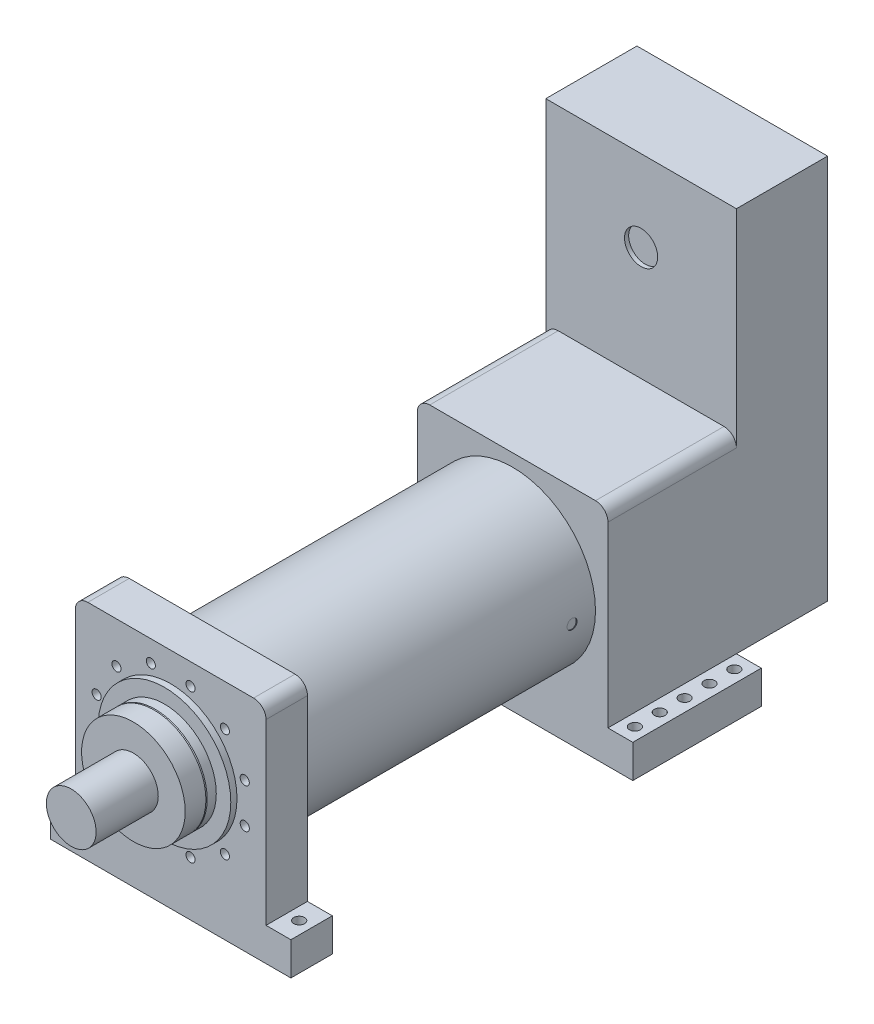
ISO-10303-21;
HEADER;
FILE_DESCRIPTION(('STEP AP214'),'2;1');
FILE_NAME('part.step','',(''),(''),'','','');
FILE_SCHEMA(('AUTOMOTIVE_DESIGN { 1 0 10303 214 1 1 1 1 }'));
ENDSEC;
DATA;
#1=APPLICATION_CONTEXT('core data for automotive mechanical design processes');
#2=APPLICATION_PROTOCOL_DEFINITION('international standard','automotive_design',2000,#1);
#3=PRODUCT_CONTEXT('',#1,'mechanical');
#4=PRODUCT('Part','Part','',(#3));
#5=PRODUCT_RELATED_PRODUCT_CATEGORY('part','',(#4));
#6=PRODUCT_DEFINITION_FORMATION('','',#4);
#7=PRODUCT_DEFINITION_CONTEXT('part definition',#1,'design');
#8=PRODUCT_DEFINITION('design','',#6,#7);
#9=PRODUCT_DEFINITION_SHAPE('','',#8);
#10=(LENGTH_UNIT() NAMED_UNIT(*) SI_UNIT(.MILLI.,.METRE.));
#11=(NAMED_UNIT(*) PLANE_ANGLE_UNIT() SI_UNIT($,.RADIAN.));
#12=(NAMED_UNIT(*) SI_UNIT($,.STERADIAN.) SOLID_ANGLE_UNIT());
#13=UNCERTAINTY_MEASURE_WITH_UNIT(LENGTH_MEASURE(1.E-05),#10,'distance_accuracy_value','');
#14=(GEOMETRIC_REPRESENTATION_CONTEXT(3) GLOBAL_UNCERTAINTY_ASSIGNED_CONTEXT((#13)) GLOBAL_UNIT_ASSIGNED_CONTEXT((#10,
#11,#12)) REPRESENTATION_CONTEXT('',''));
#15=CARTESIAN_POINT('',(0.,0.,0.));
#16=DIRECTION('',(0.,0.,1.));
#17=DIRECTION('',(1.,0.,0.));
#18=AXIS2_PLACEMENT_3D('',#15,#16,#17);
#19=CARTESIAN_POINT('',(0.,0.,1065.));
#20=DIRECTION('',(0.,0.,-1.));
#21=DIRECTION('',(-1.,0.,0.));
#22=AXIS2_PLACEMENT_3D('',#19,#20,#21);
#23=CYLINDRICAL_SURFACE('',#22,60.);
#24=CARTESIAN_POINT('',(0.,0.,1065.));
#25=DIRECTION('',(0.,0.,1.));
#26=DIRECTION('',(1.,0.,0.));
#27=AXIS2_PLACEMENT_3D('',#24,#25,#26);
#28=CIRCLE('',#27,60.);
#29=CARTESIAN_POINT('',(60.,0.,1065.));
#30=VERTEX_POINT('',#29);
#31=EDGE_CURVE('E11',#30,#30,#28,.T.);
#32=ORIENTED_EDGE('',*,*,#31,.F.);
#33=EDGE_LOOP('',(#32));
#34=FACE_BOUND('',#33,.T.);
#35=CARTESIAN_POINT('',(0.,0.,915.));
#36=DIRECTION('',(0.,0.,1.));
#37=DIRECTION('',(1.,0.,0.));
#38=AXIS2_PLACEMENT_3D('',#35,#36,#37);
#39=CIRCLE('',#38,60.);
#40=CARTESIAN_POINT('',(60.,0.,915.));
#41=VERTEX_POINT('',#40);
#42=EDGE_CURVE('E49',#41,#41,#39,.T.);
#43=ORIENTED_EDGE('',*,*,#42,.T.);
#44=EDGE_LOOP('',(#43));
#45=FACE_BOUND('',#44,.T.);
#46=ADVANCED_FACE('F46',(#34,#45),#23,.T.);
#47=CARTESIAN_POINT('',(0.,0.,1065.));
#48=DIRECTION('',(0.,0.,1.));
#49=DIRECTION('',(1.,0.,0.));
#50=AXIS2_PLACEMENT_3D('',#47,#48,#49);
#51=PLANE('',#50);
#52=ORIENTED_EDGE('',*,*,#31,.T.);
#53=EDGE_LOOP('',(#52));
#54=FACE_BOUND('',#53,.T.);
#55=ADVANCED_FACE('F61',(#54),#51,.T.);
#56=CARTESIAN_POINT('',(0.,0.,915.));
#57=DIRECTION('',(0.,0.,1.));
#58=DIRECTION('',(1.,0.,0.));
#59=AXIS2_PLACEMENT_3D('',#56,#57,#58);
#60=PLANE('',#59);
#61=ORIENTED_EDGE('',*,*,#42,.F.);
#62=EDGE_LOOP('',(#61));
#63=FACE_BOUND('',#62,.T.);
#64=ADVANCED_FACE('F59',(#63),#60,.F.);
#65=CLOSED_SHELL('',(#46,#55,#64));
#66=MANIFOLD_SOLID_BREP('B2',#65);
#67=CARTESIAN_POINT('',(0.,0.,915.));
#68=DIRECTION('',(0.,0.,-1.));
#69=DIRECTION('',(-1.,0.,0.));
#70=AXIS2_PLACEMENT_3D('',#67,#68,#69);
#71=CYLINDRICAL_SURFACE('',#70,125.);
#72=CARTESIAN_POINT('',(0.,0.,915.));
#73=DIRECTION('',(0.,0.,1.));
#74=DIRECTION('',(1.,0.,0.));
#75=AXIS2_PLACEMENT_3D('',#72,#73,#74);
#76=CIRCLE('',#75,125.);
#77=CARTESIAN_POINT('',(125.,0.,915.));
#78=VERTEX_POINT('',#77);
#79=EDGE_CURVE('E45',#78,#78,#76,.T.);
#80=ORIENTED_EDGE('',*,*,#79,.F.);
#81=EDGE_LOOP('',(#80));
#82=FACE_BOUND('',#81,.T.);
#83=CARTESIAN_POINT('',(0.,0.,865.));
#84=DIRECTION('',(0.,0.,1.));
#85=DIRECTION('',(1.,0.,0.));
#86=AXIS2_PLACEMENT_3D('',#83,#84,#85);
#87=CIRCLE('',#86,125.);
#88=CARTESIAN_POINT('',(125.,0.,865.));
#89=VERTEX_POINT('',#88);
#90=EDGE_CURVE('E98',#89,#89,#87,.T.);
#91=ORIENTED_EDGE('',*,*,#90,.T.);
#92=EDGE_LOOP('',(#91));
#93=FACE_BOUND('',#92,.T.);
#94=ADVANCED_FACE('F95',(#82,#93),#71,.T.);
#95=CARTESIAN_POINT('',(0.,0.,915.));
#96=DIRECTION('',(0.,0.,1.));
#97=DIRECTION('',(1.,0.,0.));
#98=AXIS2_PLACEMENT_3D('',#95,#96,#97);
#99=PLANE('',#98);
#100=ORIENTED_EDGE('',*,*,#79,.T.);
#101=EDGE_LOOP('',(#100));
#102=FACE_BOUND('',#101,.T.);
#103=ADVANCED_FACE('F110',(#102),#99,.T.);
#104=CARTESIAN_POINT('',(0.,0.,865.));
#105=DIRECTION('',(0.,0.,1.));
#106=DIRECTION('',(1.,0.,0.));
#107=AXIS2_PLACEMENT_3D('',#104,#105,#106);
#108=PLANE('',#107);
#109=ORIENTED_EDGE('',*,*,#90,.F.);
#110=EDGE_LOOP('',(#109));
#111=FACE_BOUND('',#110,.T.);
#112=ADVANCED_FACE('F108',(#111),#108,.F.);
#113=CLOSED_SHELL('',(#94,#103,#112));
#114=MANIFOLD_SOLID_BREP('B6',#113);
#115=CARTESIAN_POINT('',(0.,0.,865.));
#116=DIRECTION('',(0.,0.,-1.));
#117=DIRECTION('',(-1.,0.,0.));
#118=AXIS2_PLACEMENT_3D('',#115,#116,#117);
#119=CYLINDRICAL_SURFACE('',#118,125.);
#120=CARTESIAN_POINT('',(0.,0.,862.));
#121=DIRECTION('',(0.,0.,1.));
#122=DIRECTION('',(1.,0.,0.));
#123=AXIS2_PLACEMENT_3D('',#120,#121,#122);
#124=CIRCLE('',#123,125.);
#125=CARTESIAN_POINT('',(125.,0.,862.));
#126=VERTEX_POINT('',#125);
#127=EDGE_CURVE('E94',#126,#126,#124,.F.);
#128=ORIENTED_EDGE('',*,*,#127,.T.);
#129=EDGE_LOOP('',(#128));
#130=FACE_BOUND('',#129,.T.);
#131=CARTESIAN_POINT('',(0.,0.,840.));
#132=DIRECTION('',(0.,0.,1.));
#133=DIRECTION('',(1.,0.,0.));
#134=AXIS2_PLACEMENT_3D('',#131,#132,#133);
#135=CIRCLE('',#134,125.);
#136=CARTESIAN_POINT('',(125.,0.,840.));
#137=VERTEX_POINT('',#136);
#138=EDGE_CURVE('E156',#137,#137,#135,.T.);
#139=ORIENTED_EDGE('',*,*,#138,.T.);
#140=EDGE_LOOP('',(#139));
#141=FACE_BOUND('',#140,.T.);
#142=ADVANCED_FACE('F145',(#130,#141),#119,.T.);
#143=CARTESIAN_POINT('',(0.,0.,865.));
#144=DIRECTION('',(0.,0.,1.));
#145=DIRECTION('',(1.,0.,0.));
#146=AXIS2_PLACEMENT_3D('',#143,#144,#145);
#147=PLANE('',#146);
#148=CARTESIAN_POINT('',(0.,0.,865.));
#149=DIRECTION('',(0.,0.,1.));
#150=DIRECTION('',(1.,0.,0.));
#151=AXIS2_PLACEMENT_3D('',#148,#149,#150);
#152=CIRCLE('',#151,123.908089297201);
#153=CARTESIAN_POINT('',(123.908089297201,0.,865.));
#154=VERTEX_POINT('',#153);
#155=EDGE_CURVE('E152',#154,#154,#152,.T.);
#156=ORIENTED_EDGE('',*,*,#155,.T.);
#157=EDGE_LOOP('',(#156));
#158=FACE_BOUND('',#157,.T.);
#159=ADVANCED_FACE('F166',(#158),#147,.T.);
#160=CARTESIAN_POINT('',(0.,0.,840.));
#161=DIRECTION('',(0.,0.,1.));
#162=DIRECTION('',(1.,0.,0.));
#163=AXIS2_PLACEMENT_3D('',#160,#161,#162);
#164=PLANE('',#163);
#165=ORIENTED_EDGE('',*,*,#138,.F.);
#166=EDGE_LOOP('',(#165));
#167=FACE_BOUND('',#166,.T.);
#168=ADVANCED_FACE('F164',(#167),#164,.F.);
#169=CARTESIAN_POINT('',(0.,0.,865.));
#170=DIRECTION('',(0.,0.,-1.));
#171=DIRECTION('',(-1.,0.,0.));
#172=AXIS2_PLACEMENT_3D('',#169,#170,#171);
#173=CONICAL_SURFACE('',#172,123.908089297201,0.349065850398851);
#174=ORIENTED_EDGE('',*,*,#127,.F.);
#175=EDGE_LOOP('',(#174));
#176=FACE_BOUND('',#175,.T.);
#177=ORIENTED_EDGE('',*,*,#155,.F.);
#178=EDGE_LOOP('',(#177));
#179=FACE_BOUND('',#178,.T.);
#180=ADVANCED_FACE('F147',(#176,#179),#173,.T.);
#181=CLOSED_SHELL('',(#142,#159,#168,#180));
#182=MANIFOLD_SOLID_BREP('B40',#181);
#183=CARTESIAN_POINT('',(-230.,230.,-310.));
#184=DIRECTION('',(1.,0.,0.));
#185=DIRECTION('',(0.,1.,0.));
#186=AXIS2_PLACEMENT_3D('',#183,#184,#185);
#187=PLANE('',#186);
#188=DIRECTION('',(0.,1.,0.));
#189=VECTOR('',#188,1.);
#190=CARTESIAN_POINT('',(-230.,230.,0.));
#191=LINE('',#190,#189);
#192=CARTESIAN_POINT('',(-230.,-230.,0.));
#193=VERTEX_POINT('',#192);
#194=CARTESIAN_POINT('',(-230.,200.,0.));
#195=VERTEX_POINT('',#194);
#196=EDGE_CURVE('E794',#193,#195,#191,.T.);
#197=ORIENTED_EDGE('',*,*,#196,.T.);
#198=DIRECTION('',(0.,0.,1.));
#199=VECTOR('',#198,1.);
#200=CARTESIAN_POINT('',(-230.,200.,-310.));
#201=LINE('',#200,#199);
#202=CARTESIAN_POINT('',(-230.,200.,-310.));
#203=VERTEX_POINT('',#202);
#204=EDGE_CURVE('E738',#195,#203,#201,.F.);
#205=ORIENTED_EDGE('',*,*,#204,.T.);
#206=DIRECTION('',(0.,1.,0.));
#207=VECTOR('',#206,1.);
#208=CARTESIAN_POINT('',(-230.,700.,-310.));
#209=LINE('',#208,#207);
#210=CARTESIAN_POINT('',(-230.,700.,-310.));
#211=VERTEX_POINT('',#210);
#212=EDGE_CURVE('E216',#203,#211,#209,.T.);
#213=ORIENTED_EDGE('',*,*,#212,.T.);
#214=DIRECTION('',(0.,0.,1.));
#215=VECTOR('',#214,1.);
#216=CARTESIAN_POINT('',(-230.,700.,-530.));
#217=LINE('',#216,#215);
#218=CARTESIAN_POINT('',(-230.,700.,-530.));
#219=VERTEX_POINT('',#218);
#220=EDGE_CURVE('E451',#219,#211,#217,.T.);
#221=ORIENTED_EDGE('',*,*,#220,.F.);
#222=DIRECTION('',(0.,1.,0.));
#223=VECTOR('',#222,1.);
#224=CARTESIAN_POINT('',(-230.,700.,-530.));
#225=LINE('',#224,#223);
#226=CARTESIAN_POINT('',(-230.,-230.,-530.));
#227=VERTEX_POINT('',#226);
#228=EDGE_CURVE('E414',#227,#219,#225,.T.);
#229=ORIENTED_EDGE('',*,*,#228,.F.);
#230=DIRECTION('',(0.,0.,1.));
#231=VECTOR('',#230,1.);
#232=CARTESIAN_POINT('',(-230.,-230.,-530.));
#233=LINE('',#232,#231);
#234=CARTESIAN_POINT('',(-230.,-230.,-310.));
#235=VERTEX_POINT('',#234);
#236=EDGE_CURVE('E428',#227,#235,#233,.T.);
#237=ORIENTED_EDGE('',*,*,#236,.T.);
#238=DIRECTION('',(0.,0.,1.));
#239=VECTOR('',#238,1.);
#240=CARTESIAN_POINT('',(-230.,-230.,-310.));
#241=LINE('',#240,#239);
#242=EDGE_CURVE('E784',#235,#193,#241,.T.);
#243=ORIENTED_EDGE('',*,*,#242,.T.);
#244=EDGE_LOOP('',(#197,#205,#213,#221,#229,#237,#243));
#245=FACE_BOUND('',#244,.T.);
#246=ADVANCED_FACE('F201',(#245),#187,.F.);
#247=CARTESIAN_POINT('',(230.,230.,-310.));
#248=DIRECTION('',(0.,-1.,0.));
#249=DIRECTION('',(0.,0.,-1.));
#250=AXIS2_PLACEMENT_3D('',#247,#248,#249);
#251=PLANE('',#250);
#252=DIRECTION('',(1.,0.,0.));
#253=VECTOR('',#252,1.);
#254=CARTESIAN_POINT('',(230.,230.,0.));
#255=LINE('',#254,#253);
#256=CARTESIAN_POINT('',(-200.,230.,0.));
#257=VERTEX_POINT('',#256);
#258=CARTESIAN_POINT('',(200.,230.,0.));
#259=VERTEX_POINT('',#258);
#260=EDGE_CURVE('E791',#257,#259,#255,.T.);
#261=ORIENTED_EDGE('',*,*,#260,.T.);
#262=DIRECTION('',(0.,0.,1.));
#263=VECTOR('',#262,1.);
#264=CARTESIAN_POINT('',(200.,230.,-310.));
#265=LINE('',#264,#263);
#266=CARTESIAN_POINT('',(200.,230.,-310.));
#267=VERTEX_POINT('',#266);
#268=EDGE_CURVE('E224',#259,#267,#265,.F.);
#269=ORIENTED_EDGE('',*,*,#268,.T.);
#270=DIRECTION('',(1.,0.,0.));
#271=VECTOR('',#270,1.);
#272=CARTESIAN_POINT('',(230.,230.,-310.));
#273=LINE('',#272,#271);
#274=CARTESIAN_POINT('',(-200.,230.,-310.));
#275=VERTEX_POINT('',#274);
#276=EDGE_CURVE('E787',#275,#267,#273,.T.);
#277=ORIENTED_EDGE('',*,*,#276,.F.);
#278=DIRECTION('',(0.,0.,1.));
#279=VECTOR('',#278,1.);
#280=CARTESIAN_POINT('',(-200.,230.,-310.));
#281=LINE('',#280,#279);
#282=EDGE_CURVE('E744',#275,#257,#281,.T.);
#283=ORIENTED_EDGE('',*,*,#282,.T.);
#284=EDGE_LOOP('',(#261,#269,#277,#283));
#285=FACE_BOUND('',#284,.T.);
#286=ADVANCED_FACE('F705',(#285),#251,.F.);
#287=CARTESIAN_POINT('',(230.,230.,-310.));
#288=DIRECTION('',(-1.,0.,0.));
#289=DIRECTION('',(0.,-1.,0.));
#290=AXIS2_PLACEMENT_3D('',#287,#288,#289);
#291=PLANE('',#290);
#292=DIRECTION('',(0.,-1.,0.));
#293=VECTOR('',#292,1.);
#294=CARTESIAN_POINT('',(230.,700.,-310.));
#295=LINE('',#294,#293);
#296=CARTESIAN_POINT('',(230.,700.,-310.));
#297=VERTEX_POINT('',#296);
#298=CARTESIAN_POINT('',(230.,200.,-310.));
#299=VERTEX_POINT('',#298);
#300=EDGE_CURVE('E434',#297,#299,#295,.T.);
#301=ORIENTED_EDGE('',*,*,#300,.T.);
#302=DIRECTION('',(0.,0.,1.));
#303=VECTOR('',#302,1.);
#304=CARTESIAN_POINT('',(230.,200.,-310.));
#305=LINE('',#304,#303);
#306=CARTESIAN_POINT('',(230.,200.,0.));
#307=VERTEX_POINT('',#306);
#308=EDGE_CURVE('E735',#299,#307,#305,.T.);
#309=ORIENTED_EDGE('',*,*,#308,.T.);
#310=DIRECTION('',(0.,-1.,0.));
#311=VECTOR('',#310,1.);
#312=CARTESIAN_POINT('',(230.,230.,0.));
#313=LINE('',#312,#311);
#314=CARTESIAN_POINT('',(230.,-230.,0.));
#315=VERTEX_POINT('',#314);
#316=EDGE_CURVE('E788',#307,#315,#313,.T.);
#317=ORIENTED_EDGE('',*,*,#316,.T.);
#318=DIRECTION('',(0.,0.,1.));
#319=VECTOR('',#318,1.);
#320=CARTESIAN_POINT('',(230.,-230.,-310.));
#321=LINE('',#320,#319);
#322=CARTESIAN_POINT('',(230.,-230.,-310.));
#323=VERTEX_POINT('',#322);
#324=EDGE_CURVE('E600',#323,#315,#321,.T.);
#325=ORIENTED_EDGE('',*,*,#324,.F.);
#326=DIRECTION('',(0.,0.,1.));
#327=VECTOR('',#326,1.);
#328=CARTESIAN_POINT('',(230.,-230.,-530.));
#329=LINE('',#328,#327);
#330=CARTESIAN_POINT('',(230.,-230.,-530.));
#331=VERTEX_POINT('',#330);
#332=EDGE_CURVE('E443',#331,#323,#329,.T.);
#333=ORIENTED_EDGE('',*,*,#332,.F.);
#334=DIRECTION('',(0.,-1.,0.));
#335=VECTOR('',#334,1.);
#336=CARTESIAN_POINT('',(230.,700.,-530.));
#337=LINE('',#336,#335);
#338=CARTESIAN_POINT('',(230.,700.,-530.));
#339=VERTEX_POINT('',#338);
#340=EDGE_CURVE('E422',#339,#331,#337,.T.);
#341=ORIENTED_EDGE('',*,*,#340,.F.);
#342=DIRECTION('',(0.,0.,1.));
#343=VECTOR('',#342,1.);
#344=CARTESIAN_POINT('',(230.,700.,-530.));
#345=LINE('',#344,#343);
#346=EDGE_CURVE('E447',#339,#297,#345,.T.);
#347=ORIENTED_EDGE('',*,*,#346,.T.);
#348=EDGE_LOOP('',(#301,#309,#317,#325,#333,#341,#347));
#349=FACE_BOUND('',#348,.T.);
#350=ADVANCED_FACE('F711',(#349),#291,.F.);
#351=CARTESIAN_POINT('',(0.,0.,-310.));
#352=DIRECTION('',(0.,0.,-1.));
#353=DIRECTION('',(-1.,0.,0.));
#354=AXIS2_PLACEMENT_3D('',#351,#352,#353);
#355=PLANE('',#354);
#356=DIRECTION('',(-1.,0.,0.));
#357=VECTOR('',#356,1.);
#358=CARTESIAN_POINT('',(230.,-230.,-310.));
#359=LINE('',#358,#357);
#360=EDGE_CURVE('E419',#323,#235,#359,.T.);
#361=ORIENTED_EDGE('',*,*,#360,.F.);
#362=DIRECTION('',(1.,0.,0.));
#363=VECTOR('',#362,1.);
#364=CARTESIAN_POINT('',(-290.,-230.,-310.));
#365=LINE('',#364,#363);
#366=CARTESIAN_POINT('',(290.,-230.,-310.));
#367=VERTEX_POINT('',#366);
#368=EDGE_CURVE('E828',#323,#367,#365,.T.);
#369=ORIENTED_EDGE('',*,*,#368,.T.);
#370=DIRECTION('',(0.,1.,0.));
#371=VECTOR('',#370,1.);
#372=CARTESIAN_POINT('',(290.,-310.,-310.));
#373=LINE('',#372,#371);
#374=CARTESIAN_POINT('',(290.,-310.,-310.));
#375=VERTEX_POINT('',#374);
#376=EDGE_CURVE('E803',#375,#367,#373,.T.);
#377=ORIENTED_EDGE('',*,*,#376,.F.);
#378=DIRECTION('',(1.,0.,0.));
#379=VECTOR('',#378,1.);
#380=CARTESIAN_POINT('',(-290.,-310.,-310.));
#381=LINE('',#380,#379);
#382=CARTESIAN_POINT('',(-290.,-310.,-310.));
#383=VERTEX_POINT('',#382);
#384=EDGE_CURVE('E839',#383,#375,#381,.T.);
#385=ORIENTED_EDGE('',*,*,#384,.F.);
#386=DIRECTION('',(0.,1.,0.));
#387=VECTOR('',#386,1.);
#388=CARTESIAN_POINT('',(-290.,-310.,-310.));
#389=LINE('',#388,#387);
#390=CARTESIAN_POINT('',(-290.,-230.,-310.));
#391=VERTEX_POINT('',#390);
#392=EDGE_CURVE('E797',#383,#391,#389,.T.);
#393=ORIENTED_EDGE('',*,*,#392,.T.);
#394=EDGE_CURVE('E825',#391,#235,#365,.T.);
#395=ORIENTED_EDGE('',*,*,#394,.T.);
#396=EDGE_LOOP('',(#361,#369,#377,#385,#393,#395));
#397=FACE_BOUND('',#396,.T.);
#398=ADVANCED_FACE('F973',(#397),#355,.T.);
#399=CARTESIAN_POINT('',(0.,0.,0.));
#400=DIRECTION('',(0.,0.,-1.));
#401=DIRECTION('',(-1.,0.,0.));
#402=AXIS2_PLACEMENT_3D('',#399,#400,#401);
#403=PLANE('',#402);
#404=CARTESIAN_POINT('',(0.,0.,0.));
#405=DIRECTION('',(0.,0.,1.));
#406=DIRECTION('',(1.,0.,0.));
#407=AXIS2_PLACEMENT_3D('',#404,#405,#406);
#408=CIRCLE('',#407,200.);
#409=CARTESIAN_POINT('',(200.,0.,0.));
#410=VERTEX_POINT('',#409);
#411=EDGE_CURVE('E406',#410,#410,#408,.T.);
#412=ORIENTED_EDGE('',*,*,#411,.F.);
#413=EDGE_LOOP('',(#412));
#414=FACE_BOUND('',#413,.T.);
#415=ORIENTED_EDGE('',*,*,#316,.F.);
#416=CARTESIAN_POINT('',(200.,200.,0.));
#417=DIRECTION('',(0.,0.,-1.));
#418=DIRECTION('',(-1.,0.,0.));
#419=AXIS2_PLACEMENT_3D('',#416,#417,#418);
#420=CIRCLE('',#419,30.);
#421=EDGE_CURVE('E748',#307,#259,#420,.F.);
#422=ORIENTED_EDGE('',*,*,#421,.T.);
#423=ORIENTED_EDGE('',*,*,#260,.F.);
#424=CARTESIAN_POINT('',(-200.,200.,0.));
#425=DIRECTION('',(0.,0.,-1.));
#426=DIRECTION('',(-1.,0.,0.));
#427=AXIS2_PLACEMENT_3D('',#424,#425,#426);
#428=CIRCLE('',#427,30.);
#429=EDGE_CURVE('E751',#257,#195,#428,.F.);
#430=ORIENTED_EDGE('',*,*,#429,.T.);
#431=ORIENTED_EDGE('',*,*,#196,.F.);
#432=DIRECTION('',(-1.,0.,0.));
#433=VECTOR('',#432,1.);
#434=CARTESIAN_POINT('',(-290.,-230.,0.));
#435=LINE('',#434,#433);
#436=CARTESIAN_POINT('',(-290.,-230.,0.));
#437=VERTEX_POINT('',#436);
#438=EDGE_CURVE('E821',#193,#437,#435,.T.);
#439=ORIENTED_EDGE('',*,*,#438,.T.);
#440=DIRECTION('',(0.,1.,0.));
#441=VECTOR('',#440,1.);
#442=CARTESIAN_POINT('',(-290.,-310.,0.));
#443=LINE('',#442,#441);
#444=CARTESIAN_POINT('',(-290.,-310.,0.));
#445=VERTEX_POINT('',#444);
#446=EDGE_CURVE('E811',#445,#437,#443,.T.);
#447=ORIENTED_EDGE('',*,*,#446,.F.);
#448=DIRECTION('',(-1.,0.,0.));
#449=VECTOR('',#448,1.);
#450=CARTESIAN_POINT('',(-290.,-310.,0.));
#451=LINE('',#450,#449);
#452=CARTESIAN_POINT('',(290.,-310.,0.));
#453=VERTEX_POINT('',#452);
#454=EDGE_CURVE('E815',#453,#445,#451,.T.);
#455=ORIENTED_EDGE('',*,*,#454,.F.);
#456=DIRECTION('',(0.,1.,0.));
#457=VECTOR('',#456,1.);
#458=CARTESIAN_POINT('',(290.,-310.,0.));
#459=LINE('',#458,#457);
#460=CARTESIAN_POINT('',(290.,-230.,0.));
#461=VERTEX_POINT('',#460);
#462=EDGE_CURVE('E807',#453,#461,#459,.T.);
#463=ORIENTED_EDGE('',*,*,#462,.T.);
#464=EDGE_CURVE('E816',#461,#315,#435,.T.);
#465=ORIENTED_EDGE('',*,*,#464,.T.);
#466=EDGE_LOOP('',(#415,#422,#423,#430,#431,#439,#447,#455,#463,#465));
#467=FACE_BOUND('',#466,.T.);
#468=ADVANCED_FACE('F962',(#414,#467),#403,.F.);
#469=CARTESIAN_POINT('',(0.,-230.,0.));
#470=DIRECTION('',(0.,1.,0.));
#471=DIRECTION('',(0.,0.,1.));
#472=AXIS2_PLACEMENT_3D('',#469,#470,#471);
#473=PLANE('',#472);
#474=CARTESIAN_POINT('',(-260.,-230.,-35.));
#475=DIRECTION('',(0.,-1.,0.));
#476=DIRECTION('',(0.,0.,-1.));
#477=AXIS2_PLACEMENT_3D('',#474,#475,#476);
#478=CIRCLE('',#477,13.);
#479=CARTESIAN_POINT('',(-260.,-230.,-48.));
#480=VERTEX_POINT('',#479);
#481=EDGE_CURVE('E877',#480,#480,#478,.T.);
#482=ORIENTED_EDGE('',*,*,#481,.T.);
#483=EDGE_LOOP('',(#482));
#484=FACE_BOUND('',#483,.T.);
#485=CARTESIAN_POINT('',(-260.,-230.,-155.));
#486=DIRECTION('',(0.,-1.,0.));
#487=DIRECTION('',(0.,0.,-1.));
#488=AXIS2_PLACEMENT_3D('',#485,#486,#487);
#489=CIRCLE('',#488,13.);
#490=CARTESIAN_POINT('',(-260.,-230.,-168.));
#491=VERTEX_POINT('',#490);
#492=EDGE_CURVE('E861',#491,#491,#489,.T.);
#493=ORIENTED_EDGE('',*,*,#492,.T.);
#494=EDGE_LOOP('',(#493));
#495=FACE_BOUND('',#494,.T.);
#496=CARTESIAN_POINT('',(-260.,-230.,-275.));
#497=DIRECTION('',(0.,-1.,0.));
#498=DIRECTION('',(0.,0.,-1.));
#499=AXIS2_PLACEMENT_3D('',#496,#497,#498);
#500=CIRCLE('',#499,13.);
#501=CARTESIAN_POINT('',(-260.,-230.,-288.));
#502=VERTEX_POINT('',#501);
#503=EDGE_CURVE('E845',#502,#502,#500,.T.);
#504=ORIENTED_EDGE('',*,*,#503,.T.);
#505=EDGE_LOOP('',(#504));
#506=FACE_BOUND('',#505,.T.);
#507=CARTESIAN_POINT('',(-260.,-230.,-215.));
#508=DIRECTION('',(0.,-1.,0.));
#509=DIRECTION('',(0.,0.,-1.));
#510=AXIS2_PLACEMENT_3D('',#507,#508,#509);
#511=CIRCLE('',#510,13.);
#512=CARTESIAN_POINT('',(-260.,-230.,-228.));
#513=VERTEX_POINT('',#512);
#514=EDGE_CURVE('E853',#513,#513,#511,.T.);
#515=ORIENTED_EDGE('',*,*,#514,.T.);
#516=EDGE_LOOP('',(#515));
#517=FACE_BOUND('',#516,.T.);
#518=CARTESIAN_POINT('',(-260.,-230.,-95.));
#519=DIRECTION('',(0.,-1.,0.));
#520=DIRECTION('',(0.,0.,-1.));
#521=AXIS2_PLACEMENT_3D('',#518,#519,#520);
#522=CIRCLE('',#521,13.);
#523=CARTESIAN_POINT('',(-260.,-230.,-108.));
#524=VERTEX_POINT('',#523);
#525=EDGE_CURVE('E869',#524,#524,#522,.T.);
#526=ORIENTED_EDGE('',*,*,#525,.T.);
#527=EDGE_LOOP('',(#526));
#528=FACE_BOUND('',#527,.T.);
#529=ORIENTED_EDGE('',*,*,#242,.F.);
#530=ORIENTED_EDGE('',*,*,#394,.F.);
#531=DIRECTION('',(0.,0.,-1.));
#532=VECTOR('',#531,1.);
#533=CARTESIAN_POINT('',(-290.,-230.,-310.));
#534=LINE('',#533,#532);
#535=EDGE_CURVE('E829',#437,#391,#534,.T.);
#536=ORIENTED_EDGE('',*,*,#535,.F.);
#537=ORIENTED_EDGE('',*,*,#438,.F.);
#538=EDGE_LOOP('',(#529,#530,#536,#537));
#539=FACE_BOUND('',#538,.T.);
#540=ADVANCED_FACE('F971',(#484,#495,#506,#517,#528,#539),#473,.T.);
#541=CARTESIAN_POINT('',(0.,-310.,0.));
#542=DIRECTION('',(0.,1.,0.));
#543=DIRECTION('',(0.,0.,1.));
#544=AXIS2_PLACEMENT_3D('',#541,#542,#543);
#545=PLANE('',#544);
#546=DIRECTION('',(0.,0.,-1.));
#547=VECTOR('',#546,1.);
#548=CARTESIAN_POINT('',(-290.,-310.,-310.));
#549=LINE('',#548,#547);
#550=EDGE_CURVE('E820',#445,#383,#549,.T.);
#551=ORIENTED_EDGE('',*,*,#550,.T.);
#552=ORIENTED_EDGE('',*,*,#384,.T.);
#553=DIRECTION('',(0.,0.,1.));
#554=VECTOR('',#553,1.);
#555=CARTESIAN_POINT('',(290.,-310.,-310.));
#556=LINE('',#555,#554);
#557=EDGE_CURVE('E836',#375,#453,#556,.T.);
#558=ORIENTED_EDGE('',*,*,#557,.T.);
#559=ORIENTED_EDGE('',*,*,#454,.T.);
#560=EDGE_LOOP('',(#551,#552,#558,#559));
#561=FACE_BOUND('',#560,.T.);
#562=CARTESIAN_POINT('',(-260.,-310.,-275.));
#563=DIRECTION('',(0.,-1.,0.));
#564=DIRECTION('',(0.,0.,-1.));
#565=AXIS2_PLACEMENT_3D('',#562,#563,#564);
#566=CIRCLE('',#565,13.);
#567=CARTESIAN_POINT('',(-260.,-310.,-288.));
#568=VERTEX_POINT('',#567);
#569=EDGE_CURVE('E833',#568,#568,#566,.T.);
#570=ORIENTED_EDGE('',*,*,#569,.F.);
#571=EDGE_LOOP('',(#570));
#572=FACE_BOUND('',#571,.T.);
#573=CARTESIAN_POINT('',(-260.,-310.,-215.));
#574=DIRECTION('',(0.,-1.,0.));
#575=DIRECTION('',(0.,0.,-1.));
#576=AXIS2_PLACEMENT_3D('',#573,#574,#575);
#577=CIRCLE('',#576,13.);
#578=CARTESIAN_POINT('',(-260.,-310.,-228.));
#579=VERTEX_POINT('',#578);
#580=EDGE_CURVE('E849',#579,#579,#577,.T.);
#581=ORIENTED_EDGE('',*,*,#580,.F.);
#582=EDGE_LOOP('',(#581));
#583=FACE_BOUND('',#582,.T.);
#584=CARTESIAN_POINT('',(-260.,-310.,-155.));
#585=DIRECTION('',(0.,-1.,0.));
#586=DIRECTION('',(0.,0.,-1.));
#587=AXIS2_PLACEMENT_3D('',#584,#585,#586);
#588=CIRCLE('',#587,13.);
#589=CARTESIAN_POINT('',(-260.,-310.,-168.));
#590=VERTEX_POINT('',#589);
#591=EDGE_CURVE('E857',#590,#590,#588,.T.);
#592=ORIENTED_EDGE('',*,*,#591,.F.);
#593=EDGE_LOOP('',(#592));
#594=FACE_BOUND('',#593,.T.);
#595=CARTESIAN_POINT('',(-260.,-310.,-95.));
#596=DIRECTION('',(0.,-1.,0.));
#597=DIRECTION('',(0.,0.,-1.));
#598=AXIS2_PLACEMENT_3D('',#595,#596,#597);
#599=CIRCLE('',#598,13.);
#600=CARTESIAN_POINT('',(-260.,-310.,-108.));
#601=VERTEX_POINT('',#600);
#602=EDGE_CURVE('E865',#601,#601,#599,.T.);
#603=ORIENTED_EDGE('',*,*,#602,.F.);
#604=EDGE_LOOP('',(#603));
#605=FACE_BOUND('',#604,.T.);
#606=CARTESIAN_POINT('',(-260.,-310.,-35.));
#607=DIRECTION('',(0.,-1.,0.));
#608=DIRECTION('',(0.,0.,-1.));
#609=AXIS2_PLACEMENT_3D('',#606,#607,#608);
#610=CIRCLE('',#609,13.);
#611=CARTESIAN_POINT('',(-260.,-310.,-48.));
#612=VERTEX_POINT('',#611);
#613=EDGE_CURVE('E873',#612,#612,#610,.T.);
#614=ORIENTED_EDGE('',*,*,#613,.F.);
#615=EDGE_LOOP('',(#614));
#616=FACE_BOUND('',#615,.T.);
#617=CARTESIAN_POINT('',(260.,-310.,-35.));
#618=DIRECTION('',(0.,-1.,0.));
#619=DIRECTION('',(0.,0.,1.));
#620=AXIS2_PLACEMENT_3D('',#617,#618,#619);
#621=CIRCLE('',#620,13.);
#622=CARTESIAN_POINT('',(260.,-310.,-22.));
#623=VERTEX_POINT('',#622);
#624=EDGE_CURVE('E881',#623,#623,#621,.T.);
#625=ORIENTED_EDGE('',*,*,#624,.F.);
#626=EDGE_LOOP('',(#625));
#627=FACE_BOUND('',#626,.T.);
#628=CARTESIAN_POINT('',(260.,-310.,-95.));
#629=DIRECTION('',(0.,-1.,0.));
#630=DIRECTION('',(0.,0.,1.));
#631=AXIS2_PLACEMENT_3D('',#628,#629,#630);
#632=CIRCLE('',#631,13.);
#633=CARTESIAN_POINT('',(260.,-310.,-82.));
#634=VERTEX_POINT('',#633);
#635=EDGE_CURVE('E889',#634,#634,#632,.T.);
#636=ORIENTED_EDGE('',*,*,#635,.F.);
#637=EDGE_LOOP('',(#636));
#638=FACE_BOUND('',#637,.T.);
#639=CARTESIAN_POINT('',(260.,-310.,-155.));
#640=DIRECTION('',(0.,-1.,0.));
#641=DIRECTION('',(0.,0.,1.));
#642=AXIS2_PLACEMENT_3D('',#639,#640,#641);
#643=CIRCLE('',#642,13.);
#644=CARTESIAN_POINT('',(260.,-310.,-142.));
#645=VERTEX_POINT('',#644);
#646=EDGE_CURVE('E897',#645,#645,#643,.T.);
#647=ORIENTED_EDGE('',*,*,#646,.F.);
#648=EDGE_LOOP('',(#647));
#649=FACE_BOUND('',#648,.T.);
#650=CARTESIAN_POINT('',(260.,-310.,-215.));
#651=DIRECTION('',(0.,-1.,0.));
#652=DIRECTION('',(0.,0.,1.));
#653=AXIS2_PLACEMENT_3D('',#650,#651,#652);
#654=CIRCLE('',#653,13.);
#655=CARTESIAN_POINT('',(260.,-310.,-202.));
#656=VERTEX_POINT('',#655);
#657=EDGE_CURVE('E905',#656,#656,#654,.T.);
#658=ORIENTED_EDGE('',*,*,#657,.F.);
#659=EDGE_LOOP('',(#658));
#660=FACE_BOUND('',#659,.T.);
#661=CARTESIAN_POINT('',(260.,-310.,-275.));
#662=DIRECTION('',(0.,-1.,0.));
#663=DIRECTION('',(0.,0.,1.));
#664=AXIS2_PLACEMENT_3D('',#661,#662,#663);
#665=CIRCLE('',#664,13.);
#666=CARTESIAN_POINT('',(260.,-310.,-262.));
#667=VERTEX_POINT('',#666);
#668=EDGE_CURVE('E913',#667,#667,#665,.T.);
#669=ORIENTED_EDGE('',*,*,#668,.F.);
#670=EDGE_LOOP('',(#669));
#671=FACE_BOUND('',#670,.T.);
#672=ADVANCED_FACE('F977',(#561,#572,#583,#594,#605,#616,#627,#638,#649,#660,#671),#545,.F.);
#673=CARTESIAN_POINT('',(260.,-230.,-215.));
#674=DIRECTION('',(0.,-1.,0.));
#675=DIRECTION('',(0.,0.,1.));
#676=AXIS2_PLACEMENT_3D('',#673,#674,#675);
#677=CIRCLE('',#676,13.);
#678=CARTESIAN_POINT('',(260.,-230.,-202.));
#679=VERTEX_POINT('',#678);
#680=EDGE_CURVE('E909',#679,#679,#677,.T.);
#681=ORIENTED_EDGE('',*,*,#680,.T.);
#682=EDGE_LOOP('',(#681));
#683=FACE_BOUND('',#682,.T.);
#684=CARTESIAN_POINT('',(260.,-230.,-95.));
#685=DIRECTION('',(0.,-1.,0.));
#686=DIRECTION('',(0.,0.,1.));
#687=AXIS2_PLACEMENT_3D('',#684,#685,#686);
#688=CIRCLE('',#687,13.);
#689=CARTESIAN_POINT('',(260.,-230.,-82.));
#690=VERTEX_POINT('',#689);
#691=EDGE_CURVE('E893',#690,#690,#688,.T.);
#692=ORIENTED_EDGE('',*,*,#691,.T.);
#693=EDGE_LOOP('',(#692));
#694=FACE_BOUND('',#693,.T.);
#695=ORIENTED_EDGE('',*,*,#368,.F.);
#696=ORIENTED_EDGE('',*,*,#324,.T.);
#697=ORIENTED_EDGE('',*,*,#464,.F.);
#698=DIRECTION('',(0.,0.,1.));
#699=VECTOR('',#698,1.);
#700=CARTESIAN_POINT('',(290.,-230.,-310.));
#701=LINE('',#700,#699);
#702=EDGE_CURVE('E822',#367,#461,#701,.T.);
#703=ORIENTED_EDGE('',*,*,#702,.F.);
#704=EDGE_LOOP('',(#695,#696,#697,#703));
#705=FACE_BOUND('',#704,.T.);
#706=CARTESIAN_POINT('',(260.,-230.,-35.));
#707=DIRECTION('',(0.,-1.,0.));
#708=DIRECTION('',(0.,0.,1.));
#709=AXIS2_PLACEMENT_3D('',#706,#707,#708);
#710=CIRCLE('',#709,13.);
#711=CARTESIAN_POINT('',(260.,-230.,-22.));
#712=VERTEX_POINT('',#711);
#713=EDGE_CURVE('E885',#712,#712,#710,.T.);
#714=ORIENTED_EDGE('',*,*,#713,.T.);
#715=EDGE_LOOP('',(#714));
#716=FACE_BOUND('',#715,.T.);
#717=CARTESIAN_POINT('',(260.,-230.,-155.));
#718=DIRECTION('',(0.,-1.,0.));
#719=DIRECTION('',(0.,0.,1.));
#720=AXIS2_PLACEMENT_3D('',#717,#718,#719);
#721=CIRCLE('',#720,13.);
#722=CARTESIAN_POINT('',(260.,-230.,-142.));
#723=VERTEX_POINT('',#722);
#724=EDGE_CURVE('E901',#723,#723,#721,.T.);
#725=ORIENTED_EDGE('',*,*,#724,.T.);
#726=EDGE_LOOP('',(#725));
#727=FACE_BOUND('',#726,.T.);
#728=CARTESIAN_POINT('',(260.,-230.,-275.));
#729=DIRECTION('',(0.,-1.,0.));
#730=DIRECTION('',(0.,0.,1.));
#731=AXIS2_PLACEMENT_3D('',#728,#729,#730);
#732=CIRCLE('',#731,13.);
#733=CARTESIAN_POINT('',(260.,-230.,-262.));
#734=VERTEX_POINT('',#733);
#735=EDGE_CURVE('E917',#734,#734,#732,.T.);
#736=ORIENTED_EDGE('',*,*,#735,.T.);
#737=EDGE_LOOP('',(#736));
#738=FACE_BOUND('',#737,.T.);
#739=ADVANCED_FACE('F985',(#683,#694,#705,#716,#727,#738),#473,.T.);
#740=CARTESIAN_POINT('',(-290.,-310.,-310.));
#741=DIRECTION('',(1.,0.,0.));
#742=DIRECTION('',(0.,0.,-1.));
#743=AXIS2_PLACEMENT_3D('',#740,#741,#742);
#744=PLANE('',#743);
#745=ORIENTED_EDGE('',*,*,#535,.T.);
#746=ORIENTED_EDGE('',*,*,#392,.F.);
#747=ORIENTED_EDGE('',*,*,#550,.F.);
#748=ORIENTED_EDGE('',*,*,#446,.T.);
#749=EDGE_LOOP('',(#745,#746,#747,#748));
#750=FACE_BOUND('',#749,.T.);
#751=ADVANCED_FACE('F969',(#750),#744,.F.);
#752=CARTESIAN_POINT('',(290.,-310.,-310.));
#753=DIRECTION('',(-1.,0.,0.));
#754=DIRECTION('',(0.,0.,1.));
#755=AXIS2_PLACEMENT_3D('',#752,#753,#754);
#756=PLANE('',#755);
#757=ORIENTED_EDGE('',*,*,#702,.T.);
#758=ORIENTED_EDGE('',*,*,#462,.F.);
#759=ORIENTED_EDGE('',*,*,#557,.F.);
#760=ORIENTED_EDGE('',*,*,#376,.T.);
#761=EDGE_LOOP('',(#757,#758,#759,#760));
#762=FACE_BOUND('',#761,.T.);
#763=ADVANCED_FACE('F1001',(#762),#756,.F.);
#764=CARTESIAN_POINT('',(-260.,-310.,-275.));
#765=DIRECTION('',(0.,1.,0.));
#766=DIRECTION('',(0.,0.,1.));
#767=AXIS2_PLACEMENT_3D('',#764,#765,#766);
#768=CYLINDRICAL_SURFACE('',#767,13.);
#769=ORIENTED_EDGE('',*,*,#569,.T.);
#770=EDGE_LOOP('',(#769));
#771=FACE_BOUND('',#770,.T.);
#772=ORIENTED_EDGE('',*,*,#503,.F.);
#773=EDGE_LOOP('',(#772));
#774=FACE_BOUND('',#773,.T.);
#775=ADVANCED_FACE('F1003',(#771,#774),#768,.F.);
#776=CARTESIAN_POINT('',(-260.,-310.,-215.));
#777=DIRECTION('',(0.,1.,0.));
#778=DIRECTION('',(0.,0.,1.));
#779=AXIS2_PLACEMENT_3D('',#776,#777,#778);
#780=CYLINDRICAL_SURFACE('',#779,13.);
#781=ORIENTED_EDGE('',*,*,#580,.T.);
#782=EDGE_LOOP('',(#781));
#783=FACE_BOUND('',#782,.T.);
#784=ORIENTED_EDGE('',*,*,#514,.F.);
#785=EDGE_LOOP('',(#784));
#786=FACE_BOUND('',#785,.T.);
#787=ADVANCED_FACE('F1009',(#783,#786),#780,.F.);
#788=CARTESIAN_POINT('',(-260.,-310.,-155.));
#789=DIRECTION('',(0.,1.,0.));
#790=DIRECTION('',(0.,0.,1.));
#791=AXIS2_PLACEMENT_3D('',#788,#789,#790);
#792=CYLINDRICAL_SURFACE('',#791,13.);
#793=ORIENTED_EDGE('',*,*,#591,.T.);
#794=EDGE_LOOP('',(#793));
#795=FACE_BOUND('',#794,.T.);
#796=ORIENTED_EDGE('',*,*,#492,.F.);
#797=EDGE_LOOP('',(#796));
#798=FACE_BOUND('',#797,.T.);
#799=ADVANCED_FACE('F1074',(#795,#798),#792,.F.);
#800=CARTESIAN_POINT('',(-260.,-310.,-95.));
#801=DIRECTION('',(0.,1.,0.));
#802=DIRECTION('',(0.,0.,1.));
#803=AXIS2_PLACEMENT_3D('',#800,#801,#802);
#804=CYLINDRICAL_SURFACE('',#803,13.);
#805=ORIENTED_EDGE('',*,*,#602,.T.);
#806=EDGE_LOOP('',(#805));
#807=FACE_BOUND('',#806,.T.);
#808=ORIENTED_EDGE('',*,*,#525,.F.);
#809=EDGE_LOOP('',(#808));
#810=FACE_BOUND('',#809,.T.);
#811=ADVANCED_FACE('F1084',(#807,#810),#804,.F.);
#812=CARTESIAN_POINT('',(-260.,-310.,-35.));
#813=DIRECTION('',(0.,1.,0.));
#814=DIRECTION('',(0.,0.,1.));
#815=AXIS2_PLACEMENT_3D('',#812,#813,#814);
#816=CYLINDRICAL_SURFACE('',#815,13.);
#817=ORIENTED_EDGE('',*,*,#613,.T.);
#818=EDGE_LOOP('',(#817));
#819=FACE_BOUND('',#818,.T.);
#820=ORIENTED_EDGE('',*,*,#481,.F.);
#821=EDGE_LOOP('',(#820));
#822=FACE_BOUND('',#821,.T.);
#823=ADVANCED_FACE('F1094',(#819,#822),#816,.F.);
#824=CARTESIAN_POINT('',(260.,-310.,-35.));
#825=DIRECTION('',(0.,1.,0.));
#826=DIRECTION('',(0.,0.,1.));
#827=AXIS2_PLACEMENT_3D('',#824,#825,#826);
#828=CYLINDRICAL_SURFACE('',#827,13.);
#829=ORIENTED_EDGE('',*,*,#624,.T.);
#830=EDGE_LOOP('',(#829));
#831=FACE_BOUND('',#830,.T.);
#832=ORIENTED_EDGE('',*,*,#713,.F.);
#833=EDGE_LOOP('',(#832));
#834=FACE_BOUND('',#833,.T.);
#835=ADVANCED_FACE('F1104',(#831,#834),#828,.F.);
#836=CARTESIAN_POINT('',(260.,-310.,-95.));
#837=DIRECTION('',(0.,1.,0.));
#838=DIRECTION('',(0.,0.,1.));
#839=AXIS2_PLACEMENT_3D('',#836,#837,#838);
#840=CYLINDRICAL_SURFACE('',#839,13.);
#841=ORIENTED_EDGE('',*,*,#635,.T.);
#842=EDGE_LOOP('',(#841));
#843=FACE_BOUND('',#842,.T.);
#844=ORIENTED_EDGE('',*,*,#691,.F.);
#845=EDGE_LOOP('',(#844));
#846=FACE_BOUND('',#845,.T.);
#847=ADVANCED_FACE('F1114',(#843,#846),#840,.F.);
#848=CARTESIAN_POINT('',(260.,-310.,-155.));
#849=DIRECTION('',(0.,1.,0.));
#850=DIRECTION('',(0.,0.,1.));
#851=AXIS2_PLACEMENT_3D('',#848,#849,#850);
#852=CYLINDRICAL_SURFACE('',#851,13.);
#853=ORIENTED_EDGE('',*,*,#646,.T.);
#854=EDGE_LOOP('',(#853));
#855=FACE_BOUND('',#854,.T.);
#856=ORIENTED_EDGE('',*,*,#724,.F.);
#857=EDGE_LOOP('',(#856));
#858=FACE_BOUND('',#857,.T.);
#859=ADVANCED_FACE('F1124',(#855,#858),#852,.F.);
#860=CARTESIAN_POINT('',(260.,-310.,-215.));
#861=DIRECTION('',(0.,1.,0.));
#862=DIRECTION('',(0.,0.,1.));
#863=AXIS2_PLACEMENT_3D('',#860,#861,#862);
#864=CYLINDRICAL_SURFACE('',#863,13.);
#865=ORIENTED_EDGE('',*,*,#657,.T.);
#866=EDGE_LOOP('',(#865));
#867=FACE_BOUND('',#866,.T.);
#868=ORIENTED_EDGE('',*,*,#680,.F.);
#869=EDGE_LOOP('',(#868));
#870=FACE_BOUND('',#869,.T.);
#871=ADVANCED_FACE('F1134',(#867,#870),#864,.F.);
#872=CARTESIAN_POINT('',(260.,-310.,-275.));
#873=DIRECTION('',(0.,1.,0.));
#874=DIRECTION('',(0.,0.,1.));
#875=AXIS2_PLACEMENT_3D('',#872,#873,#874);
#876=CYLINDRICAL_SURFACE('',#875,13.);
#877=ORIENTED_EDGE('',*,*,#668,.T.);
#878=EDGE_LOOP('',(#877));
#879=FACE_BOUND('',#878,.T.);
#880=ORIENTED_EDGE('',*,*,#735,.F.);
#881=EDGE_LOOP('',(#880));
#882=FACE_BOUND('',#881,.T.);
#883=ADVANCED_FACE('F1144',(#879,#882),#876,.F.);
#884=CARTESIAN_POINT('',(0.,0.,725.));
#885=DIRECTION('',(0.,0.,-1.));
#886=DIRECTION('',(-1.,0.,0.));
#887=AXIS2_PLACEMENT_3D('',#884,#885,#886);
#888=CYLINDRICAL_SURFACE('',#887,200.);
#889=CARTESIAN_POINT('',(200.,0.,44.5));
#890=CARTESIAN_POINT('',(200.000000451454,-0.336818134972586,44.4999972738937));
#891=CARTESIAN_POINT('',(199.999147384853,-0.673592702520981,44.5141864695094));
#892=CARTESIAN_POINT('',(199.995759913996,-1.34485594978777,44.5708419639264));
#893=CARTESIAN_POINT('',(199.993225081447,-1.67934402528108,44.6133154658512));
#894=CARTESIAN_POINT('',(199.986541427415,-2.34388649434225,44.7263038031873));
#895=CARTESIAN_POINT('',(199.982390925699,-2.67393590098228,44.7968478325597));
#896=CARTESIAN_POINT('',(199.97259396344,-3.32690256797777,44.9654685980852));
#897=CARTESIAN_POINT('',(199.966947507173,-3.64981984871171,45.063545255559));
#898=CARTESIAN_POINT('',(199.95432206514,-4.28605714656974,45.2864689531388));
#899=CARTESIAN_POINT('',(199.947343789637,-4.59938217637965,45.411301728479));
#900=CARTESIAN_POINT('',(199.932250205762,-5.21439925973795,45.6868788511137));
#901=CARTESIAN_POINT('',(199.92413488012,-5.51609113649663,45.837623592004));
#902=CARTESIAN_POINT('',(199.906998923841,-6.10563167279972,46.1639107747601));
#903=CARTESIAN_POINT('',(199.897978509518,-6.39348361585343,46.3394472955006));
#904=CARTESIAN_POINT('',(199.879285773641,-6.95338726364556,46.7140984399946));
#905=CARTESIAN_POINT('',(199.869613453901,-7.22543901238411,46.9132129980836));
#906=CARTESIAN_POINT('',(199.84987810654,-7.75214646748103,47.3338690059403));
#907=CARTESIAN_POINT('',(199.839814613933,-8.00678041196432,47.555437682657));
#908=CARTESIAN_POINT('',(199.819593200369,-8.49648428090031,48.0192286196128));
#909=CARTESIAN_POINT('',(199.809435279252,-8.73155417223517,48.2614509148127));
#910=CARTESIAN_POINT('',(199.789312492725,-9.18047473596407,48.7648450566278));
#911=CARTESIAN_POINT('',(199.779347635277,-9.39432453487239,49.0260176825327));
#912=CARTESIAN_POINT('',(199.759894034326,-9.79927768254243,49.5654558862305));
#913=CARTESIAN_POINT('',(199.750405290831,-9.99038103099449,49.8437214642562));
#914=CARTESIAN_POINT('',(199.732166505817,-10.3486167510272,50.4155890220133));
#915=CARTESIAN_POINT('',(199.723417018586,-10.5157312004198,50.7092022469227));
#916=CARTESIAN_POINT('',(199.706913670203,-10.8246278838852,51.3094920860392));
#917=CARTESIAN_POINT('',(199.699159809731,-10.9664101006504,51.6161687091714));
#918=CARTESIAN_POINT('',(199.684868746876,-11.2236267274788,52.2404038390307));
#919=CARTESIAN_POINT('',(199.678331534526,-11.3390613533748,52.5579622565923));
#920=CARTESIAN_POINT('',(199.666660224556,-11.5427558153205,53.2017032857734));
#921=CARTESIAN_POINT('',(199.661526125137,-11.631015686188,53.5278858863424));
#922=CARTESIAN_POINT('',(199.652812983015,-11.7796353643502,54.1861499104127));
#923=CARTESIAN_POINT('',(199.649232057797,-11.8400289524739,54.5182236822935));
#924=CARTESIAN_POINT('',(199.643718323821,-11.9326397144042,55.1862908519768));
#925=CARTESIAN_POINT('',(199.641785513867,-11.9648569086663,55.5222842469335));
#926=CARTESIAN_POINT('',(199.639623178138,-12.0008826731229,56.1957928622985));
#927=CARTESIAN_POINT('',(199.639393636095,-12.0046915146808,56.5333080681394));
#928=CARTESIAN_POINT('',(199.640644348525,-11.9838738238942,57.207457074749));
#929=CARTESIAN_POINT('',(199.642124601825,-11.9592473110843,57.5440908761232));
#930=CARTESIAN_POINT('',(199.646749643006,-11.881786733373,58.2136429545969));
#931=CARTESIAN_POINT('',(199.649892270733,-11.8289892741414,58.5465654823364));
#932=CARTESIAN_POINT('',(199.657751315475,-11.6955888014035,59.2067729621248));
#933=CARTESIAN_POINT('',(199.662467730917,-11.6149858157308,59.5340579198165));
#934=CARTESIAN_POINT('',(199.673340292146,-11.4265512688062,60.1806698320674));
#935=CARTESIAN_POINT('',(199.679496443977,-11.3187195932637,60.4999967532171));
#936=CARTESIAN_POINT('',(199.693073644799,-11.0765982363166,61.1284294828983));
#937=CARTESIAN_POINT('',(199.700494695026,-10.9423085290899,61.4375352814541));
#938=CARTESIAN_POINT('',(199.716396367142,-10.6481322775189,62.0435365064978));
#939=CARTESIAN_POINT('',(199.724877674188,-10.4882291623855,62.340423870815));
#940=CARTESIAN_POINT('',(199.742655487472,-10.1440259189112,62.9196760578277));
#941=CARTESIAN_POINT('',(199.75195199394,-9.95972578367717,63.2020408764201));
#942=CARTESIAN_POINT('',(199.771096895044,-9.5680341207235,63.7502561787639));
#943=CARTESIAN_POINT('',(199.780945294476,-9.36064239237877,64.0161065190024));
#944=CARTESIAN_POINT('',(199.800915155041,-8.92423659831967,64.529413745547));
#945=CARTESIAN_POINT('',(199.811036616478,-8.69522250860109,64.7768706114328));
#946=CARTESIAN_POINT('',(199.831282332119,-8.2168118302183,65.2520193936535));
#947=CARTESIAN_POINT('',(199.841406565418,-7.96738357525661,65.4796794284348));
#948=CARTESIAN_POINT('',(199.861354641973,-7.45022594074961,65.9131810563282));
#949=CARTESIAN_POINT('',(199.871178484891,-7.18249654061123,66.1190226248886));
#950=CARTESIAN_POINT('',(199.890247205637,-6.63063236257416,66.5074255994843));
#951=CARTESIAN_POINT('',(199.899492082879,-6.34649756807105,66.6899869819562));
#952=CARTESIAN_POINT('',(199.917140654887,-5.76383629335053,67.0305297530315));
#953=CARTESIAN_POINT('',(199.92554435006,-5.46530982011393,67.1885111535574));
#954=CARTESIAN_POINT('',(199.94127250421,-4.85596814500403,67.4787734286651));
#955=CARTESIAN_POINT('',(199.94859691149,-4.54515235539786,67.6110530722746));
#956=CARTESIAN_POINT('',(199.961958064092,-3.91345386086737,67.8489554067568));
#957=CARTESIAN_POINT('',(199.967994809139,-3.5925711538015,67.9545780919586));
#958=CARTESIAN_POINT('',(199.978609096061,-2.94302558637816,68.138407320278));
#959=CARTESIAN_POINT('',(199.983186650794,-2.61436279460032,68.2166141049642));
#960=CARTESIAN_POINT('',(199.990752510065,-1.95159736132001,68.3450498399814));
#961=CARTESIAN_POINT('',(199.993740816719,-1.61749472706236,68.3952788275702));
#962=CARTESIAN_POINT('',(199.998039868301,-0.946756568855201,68.467340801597));
#963=CARTESIAN_POINT('',(199.999353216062,-0.610125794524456,68.489217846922));
#964=CARTESIAN_POINT('',(200.000273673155,0.0637847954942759,68.5045628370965));
#965=CARTESIAN_POINT('',(199.999880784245,0.40106461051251,68.4980308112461));
#966=CARTESIAN_POINT('',(199.997399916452,1.07386998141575,68.4566048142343));
#967=CARTESIAN_POINT('',(199.995311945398,1.4093955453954,68.4217109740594));
#968=CARTESIAN_POINT('',(199.98950012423,2.07630576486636,68.3238125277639));
#969=CARTESIAN_POINT('',(199.985776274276,2.4076904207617,68.2608079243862));
#970=CARTESIAN_POINT('',(199.976801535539,3.06372180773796,68.1071968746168));
#971=CARTESIAN_POINT('',(199.971551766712,3.38837329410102,68.0166106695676));
#972=CARTESIAN_POINT('',(199.959672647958,4.02888618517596,67.8084689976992));
#973=CARTESIAN_POINT('',(199.953043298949,4.34474759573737,67.6909135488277));
#974=CARTESIAN_POINT('',(199.938592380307,4.96544648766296,67.4296715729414));
#975=CARTESIAN_POINT('',(199.930770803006,5.27028389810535,67.2859848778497));
#976=CARTESIAN_POINT('',(199.914156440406,5.86677844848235,66.973503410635));
#977=CARTESIAN_POINT('',(199.905363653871,6.15843557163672,66.8047086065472));
#978=CARTESIAN_POINT('',(199.887043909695,6.72686049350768,66.4429862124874));
#979=CARTESIAN_POINT('',(199.877516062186,7.00360953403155,66.2500291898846));
#980=CARTESIAN_POINT('',(199.85800533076,7.53987480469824,65.8415150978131));
#981=CARTESIAN_POINT('',(199.84802244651,7.79939102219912,65.6259580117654));
#982=CARTESIAN_POINT('',(199.827884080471,8.29935868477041,65.1737683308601));
#983=CARTESIAN_POINT('',(199.817728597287,8.53980997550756,64.9371355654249));
#984=CARTESIAN_POINT('',(199.797532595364,8.99994549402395,64.4444693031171));
#985=CARTESIAN_POINT('',(199.787492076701,9.21962970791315,64.1884357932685));
#986=CARTESIAN_POINT('',(199.767797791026,9.63694312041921,63.6584379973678));
#987=CARTESIAN_POINT('',(199.758144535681,9.83454371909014,63.3844511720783));
#988=CARTESIAN_POINT('',(199.739512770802,10.205960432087,62.8207823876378));
#989=CARTESIAN_POINT('',(199.730534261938,10.3797765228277,62.5311004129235));
#990=CARTESIAN_POINT('',(199.713507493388,10.7023843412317,61.9380971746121));
#991=CARTESIAN_POINT('',(199.70545922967,10.8511761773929,61.6347759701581));
#992=CARTESIAN_POINT('',(199.690522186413,11.1226725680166,61.0166473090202));
#993=CARTESIAN_POINT('',(199.683633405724,11.245377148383,60.7018398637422));
#994=CARTESIAN_POINT('',(199.671215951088,11.463746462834,60.0631910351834));
#995=CARTESIAN_POINT('',(199.665686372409,11.5594291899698,59.7393558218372));
#996=CARTESIAN_POINT('',(199.656139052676,11.7231767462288,59.0847544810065));
#997=CARTESIAN_POINT('',(199.652121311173,11.7912415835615,58.7539883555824));
#998=CARTESIAN_POINT('',(199.645712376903,11.8992631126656,58.0878845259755));
#999=CARTESIAN_POINT('',(199.643321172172,11.9392200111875,57.7525468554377));
#1000=CARTESIAN_POINT('',(199.640233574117,11.99073839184,57.079689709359));
#1001=CARTESIAN_POINT('',(199.639537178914,12.0022999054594,56.7421702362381));
#1002=CARTESIAN_POINT('',(199.639858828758,11.9969484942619,56.0678915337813));
#1003=CARTESIAN_POINT('',(199.640874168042,11.9800805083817,55.731131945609));
#1004=CARTESIAN_POINT('',(199.644585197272,11.9180771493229,55.0602348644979));
#1005=CARTESIAN_POINT('',(199.647280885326,11.8729418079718,54.7260973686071));
#1006=CARTESIAN_POINT('',(199.654275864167,11.754727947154,54.0628194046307));
#1007=CARTESIAN_POINT('',(199.658575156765,11.6816493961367,53.7336789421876));
#1008=CARTESIAN_POINT('',(199.668655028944,11.5080731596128,53.0827324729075));
#1009=CARTESIAN_POINT('',(199.674435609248,11.4075754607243,52.7609264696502));
#1010=CARTESIAN_POINT('',(199.687313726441,11.1798805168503,52.1269324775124));
#1011=CARTESIAN_POINT('',(199.694411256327,11.0526834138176,51.814744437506));
#1012=CARTESIAN_POINT('',(199.709721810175,10.7724967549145,51.2021943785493));
#1013=CARTESIAN_POINT('',(199.71793483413,10.6195071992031,50.901832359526));
#1014=CARTESIAN_POINT('',(199.735243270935,10.2888285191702,50.3150654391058));
#1015=CARTESIAN_POINT('',(199.744338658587,10.1111401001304,50.028660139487));
#1016=CARTESIAN_POINT('',(199.763154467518,9.73232068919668,49.4718189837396));
#1017=CARTESIAN_POINT('',(199.772874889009,9.53118968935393,49.201383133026));
#1018=CARTESIAN_POINT('',(199.792680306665,9.10659722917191,48.678005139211));
#1019=CARTESIAN_POINT('',(199.802765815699,8.88310351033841,48.4250891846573));
#1020=CARTESIAN_POINT('',(199.823002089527,8.41561396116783,47.9389745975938));
#1021=CARTESIAN_POINT('',(199.833152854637,8.17161803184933,47.7057760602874));
#1022=CARTESIAN_POINT('',(199.853234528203,7.66478752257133,47.2606924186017));
#1023=CARTESIAN_POINT('',(199.863165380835,7.40194822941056,47.0488126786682));
#1024=CARTESIAN_POINT('',(199.882523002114,6.8593497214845,46.6479393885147));
#1025=CARTESIAN_POINT('',(199.891949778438,6.57959076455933,46.4589454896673));
#1026=CARTESIAN_POINT('',(199.910042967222,6.00478830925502,46.1049735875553));
#1027=CARTESIAN_POINT('',(199.918708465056,5.7097270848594,45.9400243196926));
#1028=CARTESIAN_POINT('',(199.935020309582,5.10672265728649,45.6355873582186));
#1029=CARTESIAN_POINT('',(199.942666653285,4.79877941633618,45.4960997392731));
#1030=CARTESIAN_POINT('',(199.95671533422,4.17252410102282,45.243718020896));
#1031=CARTESIAN_POINT('',(199.96311897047,3.85422326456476,45.1307961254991));
#1032=CARTESIAN_POINT('',(199.974509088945,3.20932132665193,44.9321958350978));
#1033=CARTESIAN_POINT('',(199.979495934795,2.88272237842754,44.8465104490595));
#1034=CARTESIAN_POINT('',(199.989051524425,2.13414018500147,44.6835216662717));
#1035=CARTESIAN_POINT('',(199.99314188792,1.71026312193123,44.6147621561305));
#1036=CARTESIAN_POINT('',(199.998615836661,0.857567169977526,44.5230030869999));
#1037=CARTESIAN_POINT('',(199.999999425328,0.428748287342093,44.5000034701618));
#1038=CARTESIAN_POINT('',(200.,0.,44.5));
#1039=B_SPLINE_CURVE_WITH_KNOTS('',3,(#889,#890,#891,#892,#893,#894,#895,#896,#897,#898,#899,
#900,#901,#902,#903,#904,#905,#906,#907,#908,#909,#910,#911,#912,#913,#914,#915,#916,#917,#918,
#919,#920,#921,#922,#923,#924,#925,#926,#927,#928,#929,#930,#931,#932,#933,#934,#935,#936,#937,
#938,#939,#940,#941,#942,#943,#944,#945,#946,#947,#948,#949,#950,#951,#952,#953,#954,#955,#956,
#957,#958,#959,#960,#961,#962,#963,#964,#965,#966,#967,#968,#969,#970,#971,#972,#973,#974,#975,
#976,#977,#978,#979,#980,#981,#982,#983,#984,#985,#986,#987,#988,#989,#990,#991,#992,#993,#994,
#995,#996,#997,#998,#999,#1000,#1001,#1002,#1003,#1004,#1005,#1006,#1007,#1008,#1009,#1010,
#1011,#1012,#1013,#1014,#1015,#1016,#1017,#1018,#1019,#1020,#1021,#1022,#1023,#1024,#1025,#1026,
#1027,#1028,#1029,#1030,#1031,#1032,#1033,#1034,#1035,#1036,#1037,#1038),.UNSPECIFIED.,.T.,.F.,
(4,2,2,2,2,2,2,2,2,2,2,2,2,2,2,2,2,2,2,2,2,2,2,2,2,2,2,2,2,2,2,2,2,2,2,2,2,2,2,2,2,2,2,2,2,2,2,
2,2,2,2,2,2,2,2,2,2,2,2,2,2,2,2,2,2,2,2,2,2,2,2,2,2,2,4),(0.,1.01007974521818,2.02041682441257,
3.03180743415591,4.04319515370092,5.0540449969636,6.06491019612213,7.07553437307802,
8.08615573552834,9.09801754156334,10.1098810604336,11.1217862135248,12.1336913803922,
13.1463486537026,14.1590066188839,15.171656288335,16.1843046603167,17.1957222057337,
18.207139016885,19.2185461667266,20.2299526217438,21.2400480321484,22.250142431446,
23.2602410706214,24.2703406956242,25.2810964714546,26.2918525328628,27.3026173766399,
28.3133833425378,29.3257480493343,30.3381138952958,31.350480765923,32.3628471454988,
33.3752619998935,34.3876770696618,35.4000832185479,36.4124880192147,37.4233176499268,
38.4341462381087,39.444970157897,40.4557939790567,41.4658777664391,42.4759608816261,
43.4860504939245,44.4961413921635,45.5074749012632,46.5188091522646,47.5301515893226,
48.5414947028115,49.5541327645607,50.566771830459,51.5794065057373,52.5920401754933,
53.6039979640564,54.6159554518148,55.6279054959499,56.6398544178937,57.650205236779,
58.6605549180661,59.6709057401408,60.6812570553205,61.6916029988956,62.7019489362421,
63.7122660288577,64.7225834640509,65.7343799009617,66.7461812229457,67.75823651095,
68.7702763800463,69.7835159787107,70.7967585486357,71.8089361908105,72.8208538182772,
74.1066233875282,75.3923913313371),.UNSPECIFIED.);
#1040=CARTESIAN_POINT('',(200.,0.,44.5));
#1041=VERTEX_POINT('',#1040);
#1042=EDGE_CURVE('E921',#1041,#1041,#1039,.T.);
#1043=ORIENTED_EDGE('',*,*,#1042,.T.);
#1044=EDGE_LOOP('',(#1043));
#1045=FACE_BOUND('',#1044,.T.);
#1046=CARTESIAN_POINT('',(0.,0.,725.));
#1047=DIRECTION('',(0.,0.,1.));
#1048=DIRECTION('',(1.,0.,0.));
#1049=AXIS2_PLACEMENT_3D('',#1046,#1047,#1048);
#1050=CIRCLE('',#1049,200.);
#1051=CARTESIAN_POINT('',(200.,0.,725.));
#1052=VERTEX_POINT('',#1051);
#1053=EDGE_CURVE('E592',#1052,#1052,#1050,.T.);
#1054=ORIENTED_EDGE('',*,*,#1053,.F.);
#1055=EDGE_LOOP('',(#1054));
#1056=FACE_BOUND('',#1055,.T.);
#1057=ORIENTED_EDGE('',*,*,#411,.T.);
#1058=EDGE_LOOP('',(#1057));
#1059=FACE_BOUND('',#1058,.T.);
#1060=CARTESIAN_POINT('',(-200.,0.,682.5));
#1061=CARTESIAN_POINT('',(-200.000000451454,0.336818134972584,682.500002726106));
#1062=CARTESIAN_POINT('',(-199.999147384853,0.673592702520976,682.485813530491));
#1063=CARTESIAN_POINT('',(-199.995759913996,1.34485594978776,682.429158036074));
#1064=CARTESIAN_POINT('',(-199.993225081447,1.67934402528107,682.386684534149));
#1065=CARTESIAN_POINT('',(-199.986541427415,2.34388649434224,682.273696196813));
#1066=CARTESIAN_POINT('',(-199.982390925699,2.67393590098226,682.20315216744));
#1067=CARTESIAN_POINT('',(-199.97259396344,3.32690256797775,682.034531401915));
#1068=CARTESIAN_POINT('',(-199.966947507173,3.64981984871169,681.936454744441));
#1069=CARTESIAN_POINT('',(-199.95432206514,4.28605714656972,681.713531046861));
#1070=CARTESIAN_POINT('',(-199.947343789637,4.59938217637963,681.588698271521));
#1071=CARTESIAN_POINT('',(-199.932250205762,5.21439925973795,681.313121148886));
#1072=CARTESIAN_POINT('',(-199.92413488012,5.51609113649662,681.162376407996));
#1073=CARTESIAN_POINT('',(-199.906998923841,6.10563167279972,680.83608922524));
#1074=CARTESIAN_POINT('',(-199.897978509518,6.39348361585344,680.660552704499));
#1075=CARTESIAN_POINT('',(-199.879285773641,6.95338726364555,680.285901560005));
#1076=CARTESIAN_POINT('',(-199.869613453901,7.22543901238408,680.086787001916));
#1077=CARTESIAN_POINT('',(-199.84987810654,7.752146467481,679.66613099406));
#1078=CARTESIAN_POINT('',(-199.839814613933,8.00678041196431,679.444562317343));
#1079=CARTESIAN_POINT('',(-199.819593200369,8.49648428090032,678.980771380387));
#1080=CARTESIAN_POINT('',(-199.809435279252,8.73155417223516,678.738549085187));
#1081=CARTESIAN_POINT('',(-199.789312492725,9.18047473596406,678.235154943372));
#1082=CARTESIAN_POINT('',(-199.779347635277,9.39432453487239,677.973982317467));
#1083=CARTESIAN_POINT('',(-199.759894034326,9.79927768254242,677.434544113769));
#1084=CARTESIAN_POINT('',(-199.750405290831,9.99038103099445,677.156278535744));
#1085=CARTESIAN_POINT('',(-199.732166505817,10.3486167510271,676.584410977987));
#1086=CARTESIAN_POINT('',(-199.723417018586,10.5157312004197,676.290797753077));
#1087=CARTESIAN_POINT('',(-199.706913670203,10.8246278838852,675.690507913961));
#1088=CARTESIAN_POINT('',(-199.699159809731,10.9664101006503,675.383831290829));
#1089=CARTESIAN_POINT('',(-199.684868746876,11.2236267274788,674.759596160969));
#1090=CARTESIAN_POINT('',(-199.678331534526,11.3390613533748,674.442037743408));
#1091=CARTESIAN_POINT('',(-199.666660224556,11.5427558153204,673.798296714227));
#1092=CARTESIAN_POINT('',(-199.661526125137,11.631015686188,673.472114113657));
#1093=CARTESIAN_POINT('',(-199.652812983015,11.7796353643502,672.813850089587));
#1094=CARTESIAN_POINT('',(-199.649232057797,11.8400289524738,672.481776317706));
#1095=CARTESIAN_POINT('',(-199.643718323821,11.9326397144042,671.813709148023));
#1096=CARTESIAN_POINT('',(-199.641785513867,11.9648569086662,671.477715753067));
#1097=CARTESIAN_POINT('',(-199.639623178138,12.0008826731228,670.804207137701));
#1098=CARTESIAN_POINT('',(-199.639393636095,12.0046915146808,670.466691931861));
#1099=CARTESIAN_POINT('',(-199.640644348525,11.9838738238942,669.792542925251));
#1100=CARTESIAN_POINT('',(-199.642124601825,11.9592473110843,669.455909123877));
#1101=CARTESIAN_POINT('',(-199.646749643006,11.881786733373,668.786357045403));
#1102=CARTESIAN_POINT('',(-199.649892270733,11.8289892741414,668.453434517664));
#1103=CARTESIAN_POINT('',(-199.657751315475,11.6955888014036,667.793227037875));
#1104=CARTESIAN_POINT('',(-199.662467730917,11.6149858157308,667.465942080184));
#1105=CARTESIAN_POINT('',(-199.673340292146,11.4265512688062,666.819330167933));
#1106=CARTESIAN_POINT('',(-199.679496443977,11.3187195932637,666.500003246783));
#1107=CARTESIAN_POINT('',(-199.693073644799,11.0765982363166,665.871570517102));
#1108=CARTESIAN_POINT('',(-199.700494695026,10.9423085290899,665.562464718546));
#1109=CARTESIAN_POINT('',(-199.716396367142,10.6481322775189,664.956463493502));
#1110=CARTESIAN_POINT('',(-199.724877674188,10.4882291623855,664.659576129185));
#1111=CARTESIAN_POINT('',(-199.742655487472,10.1440259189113,664.080323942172));
#1112=CARTESIAN_POINT('',(-199.75195199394,9.95972578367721,663.79795912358));
#1113=CARTESIAN_POINT('',(-199.771096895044,9.56803412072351,663.249743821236));
#1114=CARTESIAN_POINT('',(-199.780945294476,9.36064239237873,662.983893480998));
#1115=CARTESIAN_POINT('',(-199.800915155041,8.9242365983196,662.470586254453));
#1116=CARTESIAN_POINT('',(-199.811036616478,8.69522250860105,662.223129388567));
#1117=CARTESIAN_POINT('',(-199.831282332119,8.21681183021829,661.747980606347));
#1118=CARTESIAN_POINT('',(-199.841406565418,7.96738357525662,661.520320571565));
#1119=CARTESIAN_POINT('',(-199.861354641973,7.45022594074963,661.086818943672));
#1120=CARTESIAN_POINT('',(-199.871178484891,7.18249654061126,660.880977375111));
#1121=CARTESIAN_POINT('',(-199.890247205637,6.6306323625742,660.492574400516));
#1122=CARTESIAN_POINT('',(-199.899492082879,6.34649756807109,660.310013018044));
#1123=CARTESIAN_POINT('',(-199.917140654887,5.76383629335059,659.969470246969));
#1124=CARTESIAN_POINT('',(-199.92554435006,5.46530982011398,659.811488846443));
#1125=CARTESIAN_POINT('',(-199.94127250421,4.85596814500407,659.521226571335));
#1126=CARTESIAN_POINT('',(-199.94859691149,4.54515235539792,659.388946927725));
#1127=CARTESIAN_POINT('',(-199.961958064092,3.91345386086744,659.151044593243));
#1128=CARTESIAN_POINT('',(-199.967994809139,3.59257115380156,659.045421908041));
#1129=CARTESIAN_POINT('',(-199.978609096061,2.9430255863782,658.861592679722));
#1130=CARTESIAN_POINT('',(-199.983186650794,2.61436279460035,658.783385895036));
#1131=CARTESIAN_POINT('',(-199.990752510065,1.95159736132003,658.654950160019));
#1132=CARTESIAN_POINT('',(-199.993740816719,1.61749472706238,658.60472117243));
#1133=CARTESIAN_POINT('',(-199.998039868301,0.946756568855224,658.532659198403));
#1134=CARTESIAN_POINT('',(-199.999353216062,0.610125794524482,658.510782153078));
#1135=CARTESIAN_POINT('',(-200.000273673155,-0.0637847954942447,658.495437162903));
#1136=CARTESIAN_POINT('',(-199.999880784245,-0.401064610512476,658.501969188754));
#1137=CARTESIAN_POINT('',(-199.997399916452,-1.07386998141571,658.543395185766));
#1138=CARTESIAN_POINT('',(-199.995311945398,-1.40939554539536,658.578289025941));
#1139=CARTESIAN_POINT('',(-199.98950012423,-2.07630576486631,658.676187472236));
#1140=CARTESIAN_POINT('',(-199.985776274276,-2.40769042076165,658.739192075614));
#1141=CARTESIAN_POINT('',(-199.976801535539,-3.06372180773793,658.892803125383));
#1142=CARTESIAN_POINT('',(-199.971551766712,-3.38837329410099,658.983389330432));
#1143=CARTESIAN_POINT('',(-199.959672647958,-4.02888618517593,659.191531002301));
#1144=CARTESIAN_POINT('',(-199.953043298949,-4.34474759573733,659.309086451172));
#1145=CARTESIAN_POINT('',(-199.938592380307,-4.96544648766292,659.570328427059));
#1146=CARTESIAN_POINT('',(-199.930770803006,-5.27028389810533,659.71401512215));
#1147=CARTESIAN_POINT('',(-199.914156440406,-5.86677844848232,660.026496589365));
#1148=CARTESIAN_POINT('',(-199.905363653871,-6.15843557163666,660.195291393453));
#1149=CARTESIAN_POINT('',(-199.887043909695,-6.7268604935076,660.557013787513));
#1150=CARTESIAN_POINT('',(-199.877516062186,-7.00360953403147,660.749970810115));
#1151=CARTESIAN_POINT('',(-199.85800533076,-7.53987480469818,661.158484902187));
#1152=CARTESIAN_POINT('',(-199.84802244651,-7.79939102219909,661.374041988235));
#1153=CARTESIAN_POINT('',(-199.827884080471,-8.29935868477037,661.82623166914));
#1154=CARTESIAN_POINT('',(-199.817728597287,-8.53980997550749,662.062864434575));
#1155=CARTESIAN_POINT('',(-199.797532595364,-8.9999454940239,662.555530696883));
#1156=CARTESIAN_POINT('',(-199.787492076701,-9.21962970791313,662.811564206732));
#1157=CARTESIAN_POINT('',(-199.767797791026,-9.63694312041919,663.341562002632));
#1158=CARTESIAN_POINT('',(-199.758144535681,-9.8345437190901,663.615548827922));
#1159=CARTESIAN_POINT('',(-199.739512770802,-10.205960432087,664.179217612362));
#1160=CARTESIAN_POINT('',(-199.730534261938,-10.3797765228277,664.468899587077));
#1161=CARTESIAN_POINT('',(-199.713507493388,-10.7023843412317,665.061902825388));
#1162=CARTESIAN_POINT('',(-199.70545922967,-10.8511761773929,665.365224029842));
#1163=CARTESIAN_POINT('',(-199.690522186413,-11.1226725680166,665.98335269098));
#1164=CARTESIAN_POINT('',(-199.683633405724,-11.245377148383,666.298160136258));
#1165=CARTESIAN_POINT('',(-199.671215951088,-11.4637464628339,666.936808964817));
#1166=CARTESIAN_POINT('',(-199.665686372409,-11.5594291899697,667.260644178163));
#1167=CARTESIAN_POINT('',(-199.656139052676,-11.7231767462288,667.915245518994));
#1168=CARTESIAN_POINT('',(-199.652121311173,-11.7912415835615,668.246011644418));
#1169=CARTESIAN_POINT('',(-199.645712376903,-11.8992631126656,668.912115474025));
#1170=CARTESIAN_POINT('',(-199.643321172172,-11.9392200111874,669.247453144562));
#1171=CARTESIAN_POINT('',(-199.640233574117,-11.99073839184,669.920310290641));
#1172=CARTESIAN_POINT('',(-199.639537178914,-12.0022999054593,670.257829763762));
#1173=CARTESIAN_POINT('',(-199.639858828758,-11.9969484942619,670.932108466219));
#1174=CARTESIAN_POINT('',(-199.640874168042,-11.9800805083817,671.268868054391));
#1175=CARTESIAN_POINT('',(-199.644585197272,-11.9180771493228,671.939765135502));
#1176=CARTESIAN_POINT('',(-199.647280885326,-11.8729418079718,672.273902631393));
#1177=CARTESIAN_POINT('',(-199.654275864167,-11.754727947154,672.937180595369));
#1178=CARTESIAN_POINT('',(-199.658575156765,-11.6816493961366,673.266321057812));
#1179=CARTESIAN_POINT('',(-199.668655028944,-11.5080731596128,673.917267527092));
#1180=CARTESIAN_POINT('',(-199.674435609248,-11.4075754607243,674.23907353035));
#1181=CARTESIAN_POINT('',(-199.687313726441,-11.1798805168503,674.873067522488));
#1182=CARTESIAN_POINT('',(-199.694411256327,-11.0526834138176,675.185255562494));
#1183=CARTESIAN_POINT('',(-199.709721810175,-10.7724967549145,675.797805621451));
#1184=CARTESIAN_POINT('',(-199.71793483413,-10.6195071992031,676.098167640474));
#1185=CARTESIAN_POINT('',(-199.735243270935,-10.2888285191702,676.684934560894));
#1186=CARTESIAN_POINT('',(-199.744338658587,-10.1111401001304,676.971339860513));
#1187=CARTESIAN_POINT('',(-199.763154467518,-9.73232068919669,677.52818101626));
#1188=CARTESIAN_POINT('',(-199.772874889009,-9.53118968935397,677.798616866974));
#1189=CARTESIAN_POINT('',(-199.792680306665,-9.10659722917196,678.321994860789));
#1190=CARTESIAN_POINT('',(-199.802765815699,-8.88310351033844,678.574910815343));
#1191=CARTESIAN_POINT('',(-199.823002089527,-8.41561396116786,679.061025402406));
#1192=CARTESIAN_POINT('',(-199.833152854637,-8.17161803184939,679.294223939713));
#1193=CARTESIAN_POINT('',(-199.853234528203,-7.66478752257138,679.739307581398));
#1194=CARTESIAN_POINT('',(-199.863165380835,-7.40194822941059,679.951187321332));
#1195=CARTESIAN_POINT('',(-199.882523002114,-6.8593497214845,680.352060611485));
#1196=CARTESIAN_POINT('',(-199.891949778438,-6.57959076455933,680.541054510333));
#1197=CARTESIAN_POINT('',(-199.910042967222,-6.00478830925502,680.895026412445));
#1198=CARTESIAN_POINT('',(-199.918708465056,-5.7097270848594,681.059975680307));
#1199=CARTESIAN_POINT('',(-199.935020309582,-5.10672265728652,681.364412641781));
#1200=CARTESIAN_POINT('',(-199.942666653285,-4.79877941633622,681.503900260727));
#1201=CARTESIAN_POINT('',(-199.95671533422,-4.17252410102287,681.756281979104));
#1202=CARTESIAN_POINT('',(-199.96311897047,-3.85422326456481,681.869203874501));
#1203=CARTESIAN_POINT('',(-199.974509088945,-3.20932132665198,682.067804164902));
#1204=CARTESIAN_POINT('',(-199.979495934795,-2.8827223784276,682.15348955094));
#1205=CARTESIAN_POINT('',(-199.989051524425,-2.13414018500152,682.316478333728));
#1206=CARTESIAN_POINT('',(-199.99314188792,-1.71026312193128,682.38523784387));
#1207=CARTESIAN_POINT('',(-199.998615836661,-0.857567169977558,682.476996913));
#1208=CARTESIAN_POINT('',(-199.999999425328,-0.428748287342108,682.499996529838));
#1209=CARTESIAN_POINT('',(-200.,0.,682.5));
#1210=B_SPLINE_CURVE_WITH_KNOTS('',3,(#1060,#1061,#1062,#1063,#1064,#1065,#1066,#1067,#1068,
#1069,#1070,#1071,#1072,#1073,#1074,#1075,#1076,#1077,#1078,#1079,#1080,#1081,#1082,#1083,#1084,
#1085,#1086,#1087,#1088,#1089,#1090,#1091,#1092,#1093,#1094,#1095,#1096,#1097,#1098,#1099,#1100,
#1101,#1102,#1103,#1104,#1105,#1106,#1107,#1108,#1109,#1110,#1111,#1112,#1113,#1114,#1115,#1116,
#1117,#1118,#1119,#1120,#1121,#1122,#1123,#1124,#1125,#1126,#1127,#1128,#1129,#1130,#1131,#1132,
#1133,#1134,#1135,#1136,#1137,#1138,#1139,#1140,#1141,#1142,#1143,#1144,#1145,#1146,#1147,#1148,
#1149,#1150,#1151,#1152,#1153,#1154,#1155,#1156,#1157,#1158,#1159,#1160,#1161,#1162,#1163,#1164,
#1165,#1166,#1167,#1168,#1169,#1170,#1171,#1172,#1173,#1174,#1175,#1176,#1177,#1178,#1179,#1180,
#1181,#1182,#1183,#1184,#1185,#1186,#1187,#1188,#1189,#1190,#1191,#1192,#1193,#1194,#1195,#1196,
#1197,#1198,#1199,#1200,#1201,#1202,#1203,#1204,#1205,#1206,#1207,#1208,#1209),.UNSPECIFIED.,
.T.,.F.,(4,2,2,2,2,2,2,2,2,2,2,2,2,2,2,2,2,2,2,2,2,2,2,2,2,2,2,2,2,2,2,2,2,2,2,2,2,2,2,2,2,2,2,
2,2,2,2,2,2,2,2,2,2,2,2,2,2,2,2,2,2,2,2,2,2,2,2,2,2,2,2,2,2,2,4),(0.,1.01007974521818,
2.02041682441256,3.03180743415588,4.0431951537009,5.05404499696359,6.06491019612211,
7.07553437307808,8.08615573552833,9.09801754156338,10.1098810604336,11.1217862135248,
12.1336913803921,13.1463486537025,14.1590066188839,15.1716562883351,16.1843046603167,
17.1957222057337,18.207139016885,19.2185461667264,20.2299526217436,21.2400480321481,
22.2501424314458,23.2602410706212,24.270340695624,25.2810964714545,26.2918525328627,
27.3026173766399,28.3133833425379,29.3257480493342,30.3381138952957,31.3504807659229,
32.3628471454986,33.3752619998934,34.3876770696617,35.4000832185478,36.4124880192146,
37.4233176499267,38.4341462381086,39.4449701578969,40.4557939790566,41.465877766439,
42.475960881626,43.4860504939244,44.4961413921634,45.507474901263,46.5188091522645,
47.5301515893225,48.5414947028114,49.5541327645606,50.5667718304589,51.5794065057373,
52.5920401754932,53.6039979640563,54.6159554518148,55.6279054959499,56.6398544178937,
57.650205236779,58.660554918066,59.6709057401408,60.6812570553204,61.6916029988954,
62.701948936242,63.7122660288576,64.7225834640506,65.7343799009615,66.7461812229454,
67.7582365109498,68.7702763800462,69.7835159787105,70.7967585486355,71.8089361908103,
72.8208538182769,74.106623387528,75.392391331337),.UNSPECIFIED.);
#1211=CARTESIAN_POINT('',(-200.,0.,682.5));
#1212=VERTEX_POINT('',#1211);
#1213=EDGE_CURVE('E596',#1212,#1212,#1210,.T.);
#1214=ORIENTED_EDGE('',*,*,#1213,.F.);
#1215=EDGE_LOOP('',(#1214));
#1216=FACE_BOUND('',#1215,.T.);
#1217=CARTESIAN_POINT('',(-200.,0.,48.5));
#1218=CARTESIAN_POINT('',(-200.000000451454,0.336818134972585,48.5000027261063));
#1219=CARTESIAN_POINT('',(-199.999147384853,0.673592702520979,48.4858135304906));
#1220=CARTESIAN_POINT('',(-199.995759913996,1.34485594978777,48.4291580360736));
#1221=CARTESIAN_POINT('',(-199.993225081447,1.67934402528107,48.3866845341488));
#1222=CARTESIAN_POINT('',(-199.986541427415,2.34388649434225,48.2736961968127));
#1223=CARTESIAN_POINT('',(-199.982390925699,2.67393590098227,48.2031521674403));
#1224=CARTESIAN_POINT('',(-199.97259396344,3.32690256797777,48.0345314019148));
#1225=CARTESIAN_POINT('',(-199.966947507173,3.64981984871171,47.936454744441));
#1226=CARTESIAN_POINT('',(-199.95432206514,4.28605714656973,47.7135310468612));
#1227=CARTESIAN_POINT('',(-199.947343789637,4.59938217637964,47.588698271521));
#1228=CARTESIAN_POINT('',(-199.932250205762,5.21439925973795,47.3131211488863));
#1229=CARTESIAN_POINT('',(-199.92413488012,5.51609113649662,47.162376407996));
#1230=CARTESIAN_POINT('',(-199.906998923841,6.10563167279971,46.8360892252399));
#1231=CARTESIAN_POINT('',(-199.897978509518,6.39348361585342,46.6605527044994));
#1232=CARTESIAN_POINT('',(-199.879285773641,6.95338726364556,46.2859015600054));
#1233=CARTESIAN_POINT('',(-199.869613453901,7.22543901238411,46.0867870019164));
#1234=CARTESIAN_POINT('',(-199.84987810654,7.75214646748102,45.6661309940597));
#1235=CARTESIAN_POINT('',(-199.839814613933,8.00678041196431,45.4445623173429));
#1236=CARTESIAN_POINT('',(-199.819593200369,8.4964842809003,44.9807713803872));
#1237=CARTESIAN_POINT('',(-199.809435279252,8.73155417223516,44.7385490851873));
#1238=CARTESIAN_POINT('',(-199.789312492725,9.18047473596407,44.2351549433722));
#1239=CARTESIAN_POINT('',(-199.779347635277,9.39432453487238,43.9739823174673));
#1240=CARTESIAN_POINT('',(-199.759894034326,9.79927768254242,43.4345441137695));
#1241=CARTESIAN_POINT('',(-199.750405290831,9.99038103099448,43.1562785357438));
#1242=CARTESIAN_POINT('',(-199.732166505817,10.3486167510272,42.5844109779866));
#1243=CARTESIAN_POINT('',(-199.723417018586,10.5157312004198,42.2907977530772));
#1244=CARTESIAN_POINT('',(-199.706913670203,10.8246278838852,41.6905079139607));
#1245=CARTESIAN_POINT('',(-199.699159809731,10.9664101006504,41.3838312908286));
#1246=CARTESIAN_POINT('',(-199.684868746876,11.2236267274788,40.7595961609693));
#1247=CARTESIAN_POINT('',(-199.678331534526,11.3390613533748,40.4420377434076));
#1248=CARTESIAN_POINT('',(-199.666660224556,11.5427558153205,39.7982967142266));
#1249=CARTESIAN_POINT('',(-199.661526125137,11.631015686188,39.4721141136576));
#1250=CARTESIAN_POINT('',(-199.652812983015,11.7796353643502,38.8138500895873));
#1251=CARTESIAN_POINT('',(-199.649232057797,11.8400289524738,38.4817763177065));
#1252=CARTESIAN_POINT('',(-199.643718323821,11.9326397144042,37.8137091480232));
#1253=CARTESIAN_POINT('',(-199.641785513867,11.9648569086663,37.4777157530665));
#1254=CARTESIAN_POINT('',(-199.639623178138,12.0008826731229,36.8042071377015));
#1255=CARTESIAN_POINT('',(-199.639393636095,12.0046915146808,36.4666919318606));
#1256=CARTESIAN_POINT('',(-199.640644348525,11.9838738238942,35.792542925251));
#1257=CARTESIAN_POINT('',(-199.642124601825,11.9592473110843,35.4559091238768));
#1258=CARTESIAN_POINT('',(-199.646749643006,11.881786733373,34.7863570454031));
#1259=CARTESIAN_POINT('',(-199.649892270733,11.8289892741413,34.4534345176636));
#1260=CARTESIAN_POINT('',(-199.657751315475,11.6955888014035,33.7932270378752));
#1261=CARTESIAN_POINT('',(-199.662467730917,11.6149858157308,33.4659420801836));
#1262=CARTESIAN_POINT('',(-199.673340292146,11.4265512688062,32.8193301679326));
#1263=CARTESIAN_POINT('',(-199.679496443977,11.3187195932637,32.5000032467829));
#1264=CARTESIAN_POINT('',(-199.693073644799,11.0765982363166,31.8715705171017));
#1265=CARTESIAN_POINT('',(-199.700494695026,10.9423085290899,31.5624647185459));
#1266=CARTESIAN_POINT('',(-199.716396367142,10.6481322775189,30.9564634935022));
#1267=CARTESIAN_POINT('',(-199.724877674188,10.4882291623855,30.659576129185));
#1268=CARTESIAN_POINT('',(-199.742655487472,10.1440259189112,30.0803239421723));
#1269=CARTESIAN_POINT('',(-199.75195199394,9.95972578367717,29.7979591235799));
#1270=CARTESIAN_POINT('',(-199.771096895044,9.5680341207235,29.2497438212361));
#1271=CARTESIAN_POINT('',(-199.780945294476,9.36064239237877,28.9838934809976));
#1272=CARTESIAN_POINT('',(-199.800915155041,8.92423659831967,28.470586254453));
#1273=CARTESIAN_POINT('',(-199.811036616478,8.69522250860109,28.2231293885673));
#1274=CARTESIAN_POINT('',(-199.831282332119,8.21681183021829,27.7479806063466));
#1275=CARTESIAN_POINT('',(-199.841406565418,7.96738357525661,27.5203205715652));
#1276=CARTESIAN_POINT('',(-199.861354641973,7.45022594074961,27.0868189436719));
#1277=CARTESIAN_POINT('',(-199.871178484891,7.18249654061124,26.8809773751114));
#1278=CARTESIAN_POINT('',(-199.890247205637,6.63063236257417,26.4925744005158));
#1279=CARTESIAN_POINT('',(-199.899492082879,6.34649756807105,26.3100130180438));
#1280=CARTESIAN_POINT('',(-199.917140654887,5.76383629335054,25.9694702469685));
#1281=CARTESIAN_POINT('',(-199.92554435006,5.46530982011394,25.8114888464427));
#1282=CARTESIAN_POINT('',(-199.94127250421,4.85596814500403,25.5212265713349));
#1283=CARTESIAN_POINT('',(-199.94859691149,4.54515235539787,25.3889469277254));
#1284=CARTESIAN_POINT('',(-199.961958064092,3.91345386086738,25.1510445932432));
#1285=CARTESIAN_POINT('',(-199.967994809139,3.59257115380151,25.0454219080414));
#1286=CARTESIAN_POINT('',(-199.978609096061,2.94302558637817,24.861592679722));
#1287=CARTESIAN_POINT('',(-199.983186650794,2.61436279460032,24.7833858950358));
#1288=CARTESIAN_POINT('',(-199.990752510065,1.95159736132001,24.6549501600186));
#1289=CARTESIAN_POINT('',(-199.993740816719,1.61749472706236,24.6047211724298));
#1290=CARTESIAN_POINT('',(-199.998039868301,0.946756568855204,24.532659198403));
#1291=CARTESIAN_POINT('',(-199.999353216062,0.610125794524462,24.510782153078));
#1292=CARTESIAN_POINT('',(-200.000273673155,-0.0637847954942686,24.4954371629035));
#1293=CARTESIAN_POINT('',(-199.999880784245,-0.401064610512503,24.5019691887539));
#1294=CARTESIAN_POINT('',(-199.997399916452,-1.07386998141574,24.5433951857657));
#1295=CARTESIAN_POINT('',(-199.995311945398,-1.4093955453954,24.5782890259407));
#1296=CARTESIAN_POINT('',(-199.98950012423,-2.07630576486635,24.6761874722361));
#1297=CARTESIAN_POINT('',(-199.985776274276,-2.40769042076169,24.7391920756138));
#1298=CARTESIAN_POINT('',(-199.976801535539,-3.06372180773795,24.8928031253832));
#1299=CARTESIAN_POINT('',(-199.971551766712,-3.388373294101,24.9833893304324));
#1300=CARTESIAN_POINT('',(-199.959672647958,-4.02888618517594,25.1915310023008));
#1301=CARTESIAN_POINT('',(-199.953043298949,-4.34474759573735,25.3090864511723));
#1302=CARTESIAN_POINT('',(-199.938592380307,-4.96544648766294,25.5703284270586));
#1303=CARTESIAN_POINT('',(-199.930770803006,-5.27028389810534,25.7140151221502));
#1304=CARTESIAN_POINT('',(-199.914156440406,-5.86677844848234,26.026496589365));
#1305=CARTESIAN_POINT('',(-199.905363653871,-6.1584355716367,26.1952913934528));
#1306=CARTESIAN_POINT('',(-199.887043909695,-6.72686049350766,26.5570137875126));
#1307=CARTESIAN_POINT('',(-199.877516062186,-7.00360953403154,26.7499708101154));
#1308=CARTESIAN_POINT('',(-199.85800533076,-7.53987480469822,27.1584849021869));
#1309=CARTESIAN_POINT('',(-199.84802244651,-7.79939102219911,27.3740419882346));
#1310=CARTESIAN_POINT('',(-199.827884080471,-8.29935868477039,27.8262316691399));
#1311=CARTESIAN_POINT('',(-199.817728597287,-8.53980997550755,28.0628644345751));
#1312=CARTESIAN_POINT('',(-199.797532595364,-8.99994549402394,28.5555306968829));
#1313=CARTESIAN_POINT('',(-199.787492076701,-9.21962970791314,28.8115642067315));
#1314=CARTESIAN_POINT('',(-199.767797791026,-9.63694312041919,29.3415620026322));
#1315=CARTESIAN_POINT('',(-199.758144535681,-9.83454371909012,29.6155488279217));
#1316=CARTESIAN_POINT('',(-199.739512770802,-10.205960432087,30.1792176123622));
#1317=CARTESIAN_POINT('',(-199.730534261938,-10.3797765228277,30.4688995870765));
#1318=CARTESIAN_POINT('',(-199.713507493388,-10.7023843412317,31.0619028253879));
#1319=CARTESIAN_POINT('',(-199.70545922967,-10.8511761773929,31.3652240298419));
#1320=CARTESIAN_POINT('',(-199.690522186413,-11.1226725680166,31.9833526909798));
#1321=CARTESIAN_POINT('',(-199.683633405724,-11.245377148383,32.2981601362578));
#1322=CARTESIAN_POINT('',(-199.671215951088,-11.463746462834,32.9368089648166));
#1323=CARTESIAN_POINT('',(-199.665686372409,-11.5594291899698,33.2606441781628));
#1324=CARTESIAN_POINT('',(-199.656139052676,-11.7231767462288,33.9152455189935));
#1325=CARTESIAN_POINT('',(-199.652121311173,-11.7912415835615,34.2460116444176));
#1326=CARTESIAN_POINT('',(-199.645712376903,-11.8992631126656,34.9121154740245));
#1327=CARTESIAN_POINT('',(-199.643321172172,-11.9392200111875,35.2474531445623));
#1328=CARTESIAN_POINT('',(-199.640233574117,-11.99073839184,35.920310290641));
#1329=CARTESIAN_POINT('',(-199.639537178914,-12.0022999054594,36.2578297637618));
#1330=CARTESIAN_POINT('',(-199.639858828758,-11.9969484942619,36.9321084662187));
#1331=CARTESIAN_POINT('',(-199.640874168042,-11.9800805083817,37.268868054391));
#1332=CARTESIAN_POINT('',(-199.644585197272,-11.9180771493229,37.9397651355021));
#1333=CARTESIAN_POINT('',(-199.647280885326,-11.8729418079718,38.2739026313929));
#1334=CARTESIAN_POINT('',(-199.654275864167,-11.754727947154,38.9371805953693));
#1335=CARTESIAN_POINT('',(-199.658575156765,-11.6816493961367,39.2663210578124));
#1336=CARTESIAN_POINT('',(-199.668655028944,-11.5080731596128,39.9172675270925));
#1337=CARTESIAN_POINT('',(-199.674435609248,-11.4075754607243,40.2390735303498));
#1338=CARTESIAN_POINT('',(-199.687313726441,-11.1798805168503,40.8730675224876));
#1339=CARTESIAN_POINT('',(-199.694411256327,-11.0526834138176,41.185255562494));
#1340=CARTESIAN_POINT('',(-199.709721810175,-10.7724967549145,41.7978056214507));
#1341=CARTESIAN_POINT('',(-199.71793483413,-10.6195071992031,42.098167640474));
#1342=CARTESIAN_POINT('',(-199.735243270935,-10.2888285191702,42.6849345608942));
#1343=CARTESIAN_POINT('',(-199.744338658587,-10.1111401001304,42.971339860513));
#1344=CARTESIAN_POINT('',(-199.763154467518,-9.73232068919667,43.5281810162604));
#1345=CARTESIAN_POINT('',(-199.772874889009,-9.53118968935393,43.798616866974));
#1346=CARTESIAN_POINT('',(-199.792680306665,-9.10659722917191,44.321994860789));
#1347=CARTESIAN_POINT('',(-199.802765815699,-8.8831035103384,44.5749108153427));
#1348=CARTESIAN_POINT('',(-199.823002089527,-8.41561396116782,45.0610254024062));
#1349=CARTESIAN_POINT('',(-199.833152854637,-8.17161803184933,45.2942239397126));
#1350=CARTESIAN_POINT('',(-199.853234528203,-7.66478752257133,45.7393075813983));
#1351=CARTESIAN_POINT('',(-199.863165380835,-7.40194822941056,45.9511873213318));
#1352=CARTESIAN_POINT('',(-199.882523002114,-6.8593497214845,46.3520606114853));
#1353=CARTESIAN_POINT('',(-199.891949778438,-6.57959076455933,46.5410545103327));
#1354=CARTESIAN_POINT('',(-199.910042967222,-6.00478830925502,46.8950264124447));
#1355=CARTESIAN_POINT('',(-199.918708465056,-5.70972708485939,47.0599756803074));
#1356=CARTESIAN_POINT('',(-199.935020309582,-5.10672265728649,47.3644126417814));
#1357=CARTESIAN_POINT('',(-199.942666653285,-4.79877941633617,47.5039002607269));
#1358=CARTESIAN_POINT('',(-199.95671533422,-4.17252410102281,47.756281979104));
#1359=CARTESIAN_POINT('',(-199.96311897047,-3.85422326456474,47.8692038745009));
#1360=CARTESIAN_POINT('',(-199.974509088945,-3.20932132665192,48.0678041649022));
#1361=CARTESIAN_POINT('',(-199.979495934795,-2.88272237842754,48.1534895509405));
#1362=CARTESIAN_POINT('',(-199.989051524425,-2.13414018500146,48.3164783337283));
#1363=CARTESIAN_POINT('',(-199.99314188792,-1.71026312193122,48.3852378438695));
#1364=CARTESIAN_POINT('',(-199.998615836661,-0.85756716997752,48.4769969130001));
#1365=CARTESIAN_POINT('',(-199.999999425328,-0.42874828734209,48.4999965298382));
#1366=CARTESIAN_POINT('',(-200.,0.,48.5));
#1367=B_SPLINE_CURVE_WITH_KNOTS('',3,(#1217,#1218,#1219,#1220,#1221,#1222,#1223,#1224,#1225,
#1226,#1227,#1228,#1229,#1230,#1231,#1232,#1233,#1234,#1235,#1236,#1237,#1238,#1239,#1240,#1241,
#1242,#1243,#1244,#1245,#1246,#1247,#1248,#1249,#1250,#1251,#1252,#1253,#1254,#1255,#1256,#1257,
#1258,#1259,#1260,#1261,#1262,#1263,#1264,#1265,#1266,#1267,#1268,#1269,#1270,#1271,#1272,#1273,
#1274,#1275,#1276,#1277,#1278,#1279,#1280,#1281,#1282,#1283,#1284,#1285,#1286,#1287,#1288,#1289,
#1290,#1291,#1292,#1293,#1294,#1295,#1296,#1297,#1298,#1299,#1300,#1301,#1302,#1303,#1304,#1305,
#1306,#1307,#1308,#1309,#1310,#1311,#1312,#1313,#1314,#1315,#1316,#1317,#1318,#1319,#1320,#1321,
#1322,#1323,#1324,#1325,#1326,#1327,#1328,#1329,#1330,#1331,#1332,#1333,#1334,#1335,#1336,#1337,
#1338,#1339,#1340,#1341,#1342,#1343,#1344,#1345,#1346,#1347,#1348,#1349,#1350,#1351,#1352,#1353,
#1354,#1355,#1356,#1357,#1358,#1359,#1360,#1361,#1362,#1363,#1364,#1365,#1366),.UNSPECIFIED.,
.T.,.F.,(4,2,2,2,2,2,2,2,2,2,2,2,2,2,2,2,2,2,2,2,2,2,2,2,2,2,2,2,2,2,2,2,2,2,2,2,2,2,2,2,2,2,2,
2,2,2,2,2,2,2,2,2,2,2,2,2,2,2,2,2,2,2,2,2,2,2,2,2,2,2,2,2,2,2,4),(0.,1.01007974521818,
2.02041682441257,3.03180743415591,4.04319515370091,5.05404499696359,6.06491019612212,
7.07553437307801,8.08615573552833,9.09801754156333,10.1098810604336,11.1217862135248,
12.1336913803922,13.1463486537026,14.1590066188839,15.171656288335,16.1843046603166,
17.1957222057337,18.207139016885,19.2185461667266,20.2299526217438,21.2400480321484,
22.250142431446,23.2602410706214,24.2703406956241,25.2810964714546,26.2918525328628,
27.3026173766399,28.3133833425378,29.3257480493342,30.3381138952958,31.350480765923,
32.3628471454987,33.3752619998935,34.3876770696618,35.4000832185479,36.4124880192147,
37.4233176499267,38.4341462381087,39.444970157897,40.4557939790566,41.4658777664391,
42.475960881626,43.4860504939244,44.4961413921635,45.5074749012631,46.5188091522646,
47.5301515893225,48.5414947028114,49.5541327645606,50.5667718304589,51.5794065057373,
52.5920401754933,53.6039979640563,54.6159554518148,55.6279054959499,56.6398544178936,
57.6502052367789,58.660554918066,59.6709057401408,60.6812570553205,61.6916029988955,
62.7019489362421,63.7122660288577,64.7225834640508,65.7343799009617,66.7461812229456,
67.75823651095,68.7702763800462,69.7835159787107,70.7967585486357,71.8089361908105,
72.8208538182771,74.1066233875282,75.392391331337),.UNSPECIFIED.);
#1368=CARTESIAN_POINT('',(-200.,0.,48.5));
#1369=VERTEX_POINT('',#1368);
#1370=EDGE_CURVE('E609',#1369,#1369,#1367,.T.);
#1371=ORIENTED_EDGE('',*,*,#1370,.F.);
#1372=EDGE_LOOP('',(#1371));
#1373=FACE_BOUND('',#1372,.T.);
#1374=ADVANCED_FACE('F615',(#1045,#1056,#1059,#1216,#1373),#888,.T.);
#1375=CARTESIAN_POINT('',(0.,0.,725.));
#1376=DIRECTION('',(0.,0.,1.));
#1377=DIRECTION('',(1.,0.,0.));
#1378=AXIS2_PLACEMENT_3D('',#1375,#1376,#1377);
#1379=PLANE('',#1378);
#1380=DIRECTION('',(0.,-1.,0.));
#1381=VECTOR('',#1380,1.);
#1382=CARTESIAN_POINT('',(-230.,230.,725.));
#1383=LINE('',#1382,#1381);
#1384=CARTESIAN_POINT('',(-230.,200.,725.));
#1385=VERTEX_POINT('',#1384);
#1386=CARTESIAN_POINT('',(-230.,-230.,725.));
#1387=VERTEX_POINT('',#1386);
#1388=EDGE_CURVE('E569',#1385,#1387,#1383,.T.);
#1389=ORIENTED_EDGE('',*,*,#1388,.F.);
#1390=CARTESIAN_POINT('',(-200.,200.,725.));
#1391=DIRECTION('',(0.,0.,1.));
#1392=DIRECTION('',(1.,0.,0.));
#1393=AXIS2_PLACEMENT_3D('',#1390,#1391,#1392);
#1394=CIRCLE('',#1393,30.);
#1395=CARTESIAN_POINT('',(-200.,230.,725.));
#1396=VERTEX_POINT('',#1395);
#1397=EDGE_CURVE('E772',#1385,#1396,#1394,.F.);
#1398=ORIENTED_EDGE('',*,*,#1397,.T.);
#1399=DIRECTION('',(-1.,0.,0.));
#1400=VECTOR('',#1399,1.);
#1401=CARTESIAN_POINT('',(-230.,230.,725.));
#1402=LINE('',#1401,#1400);
#1403=CARTESIAN_POINT('',(200.,230.,725.));
#1404=VERTEX_POINT('',#1403);
#1405=EDGE_CURVE('E580',#1404,#1396,#1402,.T.);
#1406=ORIENTED_EDGE('',*,*,#1405,.F.);
#1407=CARTESIAN_POINT('',(200.,200.,725.));
#1408=DIRECTION('',(0.,0.,1.));
#1409=DIRECTION('',(1.,0.,0.));
#1410=AXIS2_PLACEMENT_3D('',#1407,#1408,#1409);
#1411=CIRCLE('',#1410,30.);
#1412=CARTESIAN_POINT('',(230.,200.,725.));
#1413=VERTEX_POINT('',#1412);
#1414=EDGE_CURVE('E775',#1404,#1413,#1411,.F.);
#1415=ORIENTED_EDGE('',*,*,#1414,.T.);
#1416=DIRECTION('',(0.,1.,0.));
#1417=VECTOR('',#1416,1.);
#1418=CARTESIAN_POINT('',(230.,230.,725.));
#1419=LINE('',#1418,#1417);
#1420=CARTESIAN_POINT('',(230.,-230.,725.));
#1421=VERTEX_POINT('',#1420);
#1422=EDGE_CURVE('E560',#1421,#1413,#1419,.T.);
#1423=ORIENTED_EDGE('',*,*,#1422,.F.);
#1424=DIRECTION('',(1.,0.,0.));
#1425=VECTOR('',#1424,1.);
#1426=CARTESIAN_POINT('',(-290.,-230.,725.));
#1427=LINE('',#1426,#1425);
#1428=CARTESIAN_POINT('',(290.,-230.,725.));
#1429=VERTEX_POINT('',#1428);
#1430=EDGE_CURVE('E1627',#1421,#1429,#1427,.T.);
#1431=ORIENTED_EDGE('',*,*,#1430,.T.);
#1432=DIRECTION('',(0.,1.,0.));
#1433=VECTOR('',#1432,1.);
#1434=CARTESIAN_POINT('',(290.,-310.,725.));
#1435=LINE('',#1434,#1433);
#1436=CARTESIAN_POINT('',(290.,-310.,725.));
#1437=VERTEX_POINT('',#1436);
#1438=EDGE_CURVE('E368',#1437,#1429,#1435,.T.);
#1439=ORIENTED_EDGE('',*,*,#1438,.F.);
#1440=DIRECTION('',(1.,0.,0.));
#1441=VECTOR('',#1440,1.);
#1442=CARTESIAN_POINT('',(-290.,-310.,725.));
#1443=LINE('',#1442,#1441);
#1444=CARTESIAN_POINT('',(-290.,-310.,725.));
#1445=VERTEX_POINT('',#1444);
#1446=EDGE_CURVE('E358',#1445,#1437,#1443,.T.);
#1447=ORIENTED_EDGE('',*,*,#1446,.F.);
#1448=DIRECTION('',(0.,1.,0.));
#1449=VECTOR('',#1448,1.);
#1450=CARTESIAN_POINT('',(-290.,-310.,725.));
#1451=LINE('',#1450,#1449);
#1452=CARTESIAN_POINT('',(-290.,-230.,725.));
#1453=VERTEX_POINT('',#1452);
#1454=EDGE_CURVE('E365',#1445,#1453,#1451,.T.);
#1455=ORIENTED_EDGE('',*,*,#1454,.T.);
#1456=EDGE_CURVE('E1628',#1453,#1387,#1427,.T.);
#1457=ORIENTED_EDGE('',*,*,#1456,.T.);
#1458=EDGE_LOOP('',(#1389,#1398,#1406,#1415,#1423,#1431,#1439,#1447,#1455,#1457));
#1459=FACE_BOUND('',#1458,.T.);
#1460=ORIENTED_EDGE('',*,*,#1053,.T.);
#1461=EDGE_LOOP('',(#1460));
#1462=FACE_BOUND('',#1461,.T.);
#1463=ADVANCED_FACE('F361',(#1459,#1462),#1379,.F.);
#1464=CARTESIAN_POINT('',(0.,0.,825.));
#1465=DIRECTION('',(0.,0.,1.));
#1466=DIRECTION('',(1.,0.,0.));
#1467=AXIS2_PLACEMENT_3D('',#1464,#1465,#1466);
#1468=PLANE('',#1467);
#1469=CARTESIAN_POINT('',(0.,0.,825.));
#1470=DIRECTION('',(0.,0.,1.));
#1471=DIRECTION('',(1.,0.,0.));
#1472=AXIS2_PLACEMENT_3D('',#1469,#1470,#1471);
#1473=CIRCLE('',#1472,160.);
#1474=CARTESIAN_POINT('',(160.,0.,825.));
#1475=VERTEX_POINT('',#1474);
#1476=EDGE_CURVE('E401',#1475,#1475,#1473,.T.);
#1477=ORIENTED_EDGE('',*,*,#1476,.F.);
#1478=EDGE_LOOP('',(#1477));
#1479=FACE_BOUND('',#1478,.T.);
#1480=CARTESIAN_POINT('',(47.8815233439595,178.696277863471,825.));
#1481=DIRECTION('',(0.,0.,1.));
#1482=DIRECTION('',(1.,0.,0.));
#1483=AXIS2_PLACEMENT_3D('',#1480,#1481,#1482);
#1484=CIRCLE('',#1483,11.);
#1485=CARTESIAN_POINT('',(58.8815233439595,178.696277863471,825.));
#1486=VERTEX_POINT('',#1485);
#1487=EDGE_CURVE('E476',#1486,#1486,#1484,.T.);
#1488=ORIENTED_EDGE('',*,*,#1487,.F.);
#1489=EDGE_LOOP('',(#1488));
#1490=FACE_BOUND('',#1489,.T.);
#1491=CARTESIAN_POINT('',(-130.814754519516,130.814754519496,825.));
#1492=DIRECTION('',(0.,0.,1.));
#1493=DIRECTION('',(1.,0.,0.));
#1494=AXIS2_PLACEMENT_3D('',#1491,#1492,#1493);
#1495=CIRCLE('',#1494,11.);
#1496=CARTESIAN_POINT('',(-119.814754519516,130.814754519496,825.));
#1497=VERTEX_POINT('',#1496);
#1498=EDGE_CURVE('E492',#1497,#1497,#1495,.T.);
#1499=ORIENTED_EDGE('',*,*,#1498,.F.);
#1500=EDGE_LOOP('',(#1499));
#1501=FACE_BOUND('',#1500,.T.);
#1502=CARTESIAN_POINT('',(-178.696277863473,-47.8815233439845,825.));
#1503=DIRECTION('',(0.,0.,1.));
#1504=DIRECTION('',(1.,0.,0.));
#1505=AXIS2_PLACEMENT_3D('',#1502,#1503,#1504);
#1506=CIRCLE('',#1505,10.9999999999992);
#1507=CARTESIAN_POINT('',(-167.696277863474,-47.8815233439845,825.));
#1508=VERTEX_POINT('',#1507);
#1509=EDGE_CURVE('E508',#1508,#1508,#1506,.T.);
#1510=ORIENTED_EDGE('',*,*,#1509,.F.);
#1511=EDGE_LOOP('',(#1510));
#1512=FACE_BOUND('',#1511,.T.);
#1513=CARTESIAN_POINT('',(-47.8815233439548,-178.696277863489,825.));
#1514=DIRECTION('',(0.,0.,1.));
#1515=DIRECTION('',(1.,0.,0.));
#1516=AXIS2_PLACEMENT_3D('',#1513,#1514,#1515);
#1517=CIRCLE('',#1516,11.);
#1518=CARTESIAN_POINT('',(-36.8815233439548,-178.696277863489,825.));
#1519=VERTEX_POINT('',#1518);
#1520=EDGE_CURVE('E524',#1519,#1519,#1517,.T.);
#1521=ORIENTED_EDGE('',*,*,#1520,.F.);
#1522=EDGE_LOOP('',(#1521));
#1523=FACE_BOUND('',#1522,.T.);
#1524=CARTESIAN_POINT('',(130.81475451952,-130.814754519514,825.));
#1525=DIRECTION('',(0.,0.,1.));
#1526=DIRECTION('',(1.,0.,0.));
#1527=AXIS2_PLACEMENT_3D('',#1524,#1525,#1526);
#1528=CIRCLE('',#1527,11.);
#1529=CARTESIAN_POINT('',(141.81475451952,-130.814754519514,825.));
#1530=VERTEX_POINT('',#1529);
#1531=EDGE_CURVE('E540',#1530,#1530,#1528,.T.);
#1532=ORIENTED_EDGE('',*,*,#1531,.F.);
#1533=EDGE_LOOP('',(#1532));
#1534=FACE_BOUND('',#1533,.T.);
#1535=CARTESIAN_POINT('',(178.696277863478,47.8815233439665,825.));
#1536=DIRECTION('',(0.,0.,1.));
#1537=DIRECTION('',(1.,0.,0.));
#1538=AXIS2_PLACEMENT_3D('',#1535,#1536,#1537);
#1539=CIRCLE('',#1538,11.);
#1540=CARTESIAN_POINT('',(189.696277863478,47.8815233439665,825.));
#1541=VERTEX_POINT('',#1540);
#1542=EDGE_CURVE('E556',#1541,#1541,#1539,.T.);
#1543=ORIENTED_EDGE('',*,*,#1542,.F.);
#1544=EDGE_LOOP('',(#1543));
#1545=FACE_BOUND('',#1544,.T.);
#1546=DIRECTION('',(-1.,0.,0.));
#1547=VECTOR('',#1546,1.);
#1548=CARTESIAN_POINT('',(-230.,230.,825.));
#1549=LINE('',#1548,#1547);
#1550=CARTESIAN_POINT('',(200.,230.,825.));
#1551=VERTEX_POINT('',#1550);
#1552=CARTESIAN_POINT('',(-200.,230.,825.));
#1553=VERTEX_POINT('',#1552);
#1554=EDGE_CURVE('E568',#1551,#1553,#1549,.T.);
#1555=ORIENTED_EDGE('',*,*,#1554,.T.);
#1556=CARTESIAN_POINT('',(-200.,200.,825.));
#1557=DIRECTION('',(0.,0.,1.));
#1558=DIRECTION('',(1.,0.,0.));
#1559=AXIS2_PLACEMENT_3D('',#1556,#1557,#1558);
#1560=CIRCLE('',#1559,30.);
#1561=CARTESIAN_POINT('',(-230.,200.,825.));
#1562=VERTEX_POINT('',#1561);
#1563=EDGE_CURVE('E759',#1553,#1562,#1560,.T.);
#1564=ORIENTED_EDGE('',*,*,#1563,.T.);
#1565=DIRECTION('',(0.,-1.,0.));
#1566=VECTOR('',#1565,1.);
#1567=CARTESIAN_POINT('',(-230.,230.,825.));
#1568=LINE('',#1567,#1566);
#1569=CARTESIAN_POINT('',(-230.,-230.,825.));
#1570=VERTEX_POINT('',#1569);
#1571=EDGE_CURVE('E573',#1562,#1570,#1568,.T.);
#1572=ORIENTED_EDGE('',*,*,#1571,.T.);
#1573=DIRECTION('',(-1.,0.,0.));
#1574=VECTOR('',#1573,1.);
#1575=CARTESIAN_POINT('',(-290.,-230.,825.));
#1576=LINE('',#1575,#1574);
#1577=CARTESIAN_POINT('',(-290.,-230.,825.));
#1578=VERTEX_POINT('',#1577);
#1579=EDGE_CURVE('E1634',#1570,#1578,#1576,.T.);
#1580=ORIENTED_EDGE('',*,*,#1579,.T.);
#1581=DIRECTION('',(0.,1.,0.));
#1582=VECTOR('',#1581,1.);
#1583=CARTESIAN_POINT('',(-290.,-310.,825.));
#1584=LINE('',#1583,#1582);
#1585=CARTESIAN_POINT('',(-290.,-310.,825.));
#1586=VERTEX_POINT('',#1585);
#1587=EDGE_CURVE('E1624',#1586,#1578,#1584,.T.);
#1588=ORIENTED_EDGE('',*,*,#1587,.F.);
#1589=DIRECTION('',(-1.,0.,0.));
#1590=VECTOR('',#1589,1.);
#1591=CARTESIAN_POINT('',(-290.,-310.,825.));
#1592=LINE('',#1591,#1590);
#1593=CARTESIAN_POINT('',(290.,-310.,825.));
#1594=VERTEX_POINT('',#1593);
#1595=EDGE_CURVE('E379',#1594,#1586,#1592,.T.);
#1596=ORIENTED_EDGE('',*,*,#1595,.F.);
#1597=DIRECTION('',(0.,1.,0.));
#1598=VECTOR('',#1597,1.);
#1599=CARTESIAN_POINT('',(290.,-310.,825.));
#1600=LINE('',#1599,#1598);
#1601=CARTESIAN_POINT('',(290.,-230.,825.));
#1602=VERTEX_POINT('',#1601);
#1603=EDGE_CURVE('E397',#1594,#1602,#1600,.T.);
#1604=ORIENTED_EDGE('',*,*,#1603,.T.);
#1605=CARTESIAN_POINT('',(230.,-230.,825.));
#1606=VERTEX_POINT('',#1605);
#1607=EDGE_CURVE('E384',#1602,#1606,#1576,.T.);
#1608=ORIENTED_EDGE('',*,*,#1607,.T.);
#1609=DIRECTION('',(0.,1.,0.));
#1610=VECTOR('',#1609,1.);
#1611=CARTESIAN_POINT('',(230.,230.,825.));
#1612=LINE('',#1611,#1610);
#1613=CARTESIAN_POINT('',(230.,200.,825.));
#1614=VERTEX_POINT('',#1613);
#1615=EDGE_CURVE('E564',#1606,#1614,#1612,.T.);
#1616=ORIENTED_EDGE('',*,*,#1615,.T.);
#1617=CARTESIAN_POINT('',(200.,200.,825.));
#1618=DIRECTION('',(0.,0.,1.));
#1619=DIRECTION('',(1.,0.,0.));
#1620=AXIS2_PLACEMENT_3D('',#1617,#1618,#1619);
#1621=CIRCLE('',#1620,30.);
#1622=EDGE_CURVE('E762',#1614,#1551,#1621,.T.);
#1623=ORIENTED_EDGE('',*,*,#1622,.T.);
#1624=EDGE_LOOP('',(#1555,#1564,#1572,#1580,#1588,#1596,#1604,#1608,#1616,#1623));
#1625=FACE_BOUND('',#1624,.T.);
#1626=CARTESIAN_POINT('',(178.696277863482,-47.8815233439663,825.));
#1627=DIRECTION('',(0.,0.,1.));
#1628=DIRECTION('',(1.,0.,0.));
#1629=AXIS2_PLACEMENT_3D('',#1626,#1627,#1628);
#1630=CIRCLE('',#1629,11.);
#1631=CARTESIAN_POINT('',(189.696277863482,-47.8815233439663,825.));
#1632=VERTEX_POINT('',#1631);
#1633=EDGE_CURVE('E548',#1632,#1632,#1630,.T.);
#1634=ORIENTED_EDGE('',*,*,#1633,.F.);
#1635=EDGE_LOOP('',(#1634));
#1636=FACE_BOUND('',#1635,.T.);
#1637=CARTESIAN_POINT('',(47.8815233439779,-178.696277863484,825.));
#1638=DIRECTION('',(0.,0.,1.));
#1639=DIRECTION('',(1.,0.,0.));
#1640=AXIS2_PLACEMENT_3D('',#1637,#1638,#1639);
#1641=CIRCLE('',#1640,11.);
#1642=CARTESIAN_POINT('',(58.8815233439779,-178.696277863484,825.));
#1643=VERTEX_POINT('',#1642);
#1644=EDGE_CURVE('E532',#1643,#1643,#1641,.T.);
#1645=ORIENTED_EDGE('',*,*,#1644,.F.);
#1646=EDGE_LOOP('',(#1645));
#1647=FACE_BOUND('',#1646,.T.);
#1648=CARTESIAN_POINT('',(-130.814754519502,-130.814754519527,825.));
#1649=DIRECTION('',(0.,0.,1.));
#1650=DIRECTION('',(1.,0.,0.));
#1651=AXIS2_PLACEMENT_3D('',#1648,#1649,#1650);
#1652=CIRCLE('',#1651,11.);
#1653=CARTESIAN_POINT('',(-119.814754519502,-130.814754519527,825.));
#1654=VERTEX_POINT('',#1653);
#1655=EDGE_CURVE('E516',#1654,#1654,#1652,.T.);
#1656=ORIENTED_EDGE('',*,*,#1655,.F.);
#1657=EDGE_LOOP('',(#1656));
#1658=FACE_BOUND('',#1657,.T.);
#1659=CARTESIAN_POINT('',(-178.696277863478,47.8815233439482,825.));
#1660=DIRECTION('',(0.,0.,1.));
#1661=DIRECTION('',(1.,0.,0.));
#1662=AXIS2_PLACEMENT_3D('',#1659,#1660,#1661);
#1663=CIRCLE('',#1662,11.);
#1664=CARTESIAN_POINT('',(-167.696277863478,47.8815233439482,825.));
#1665=VERTEX_POINT('',#1664);
#1666=EDGE_CURVE('E500',#1665,#1665,#1663,.T.);
#1667=ORIENTED_EDGE('',*,*,#1666,.F.);
#1668=EDGE_LOOP('',(#1667));
#1669=FACE_BOUND('',#1668,.T.);
#1670=CARTESIAN_POINT('',(-47.8815233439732,178.696277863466,825.));
#1671=DIRECTION('',(0.,0.,1.));
#1672=DIRECTION('',(1.,0.,0.));
#1673=AXIS2_PLACEMENT_3D('',#1670,#1671,#1672);
#1674=CIRCLE('',#1673,11.);
#1675=CARTESIAN_POINT('',(-36.8815233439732,178.696277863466,825.));
#1676=VERTEX_POINT('',#1675);
#1677=EDGE_CURVE('E484',#1676,#1676,#1674,.T.);
#1678=ORIENTED_EDGE('',*,*,#1677,.F.);
#1679=EDGE_LOOP('',(#1678));
#1680=FACE_BOUND('',#1679,.T.);
#1681=CARTESIAN_POINT('',(130.814754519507,130.814754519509,825.));
#1682=DIRECTION('',(0.,0.,1.));
#1683=DIRECTION('',(1.,0.,0.));
#1684=AXIS2_PLACEMENT_3D('',#1681,#1682,#1683);
#1685=CIRCLE('',#1684,11.);
#1686=CARTESIAN_POINT('',(141.814754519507,130.814754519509,825.));
#1687=VERTEX_POINT('',#1686);
#1688=EDGE_CURVE('E468',#1687,#1687,#1685,.T.);
#1689=ORIENTED_EDGE('',*,*,#1688,.F.);
#1690=EDGE_LOOP('',(#1689));
#1691=FACE_BOUND('',#1690,.T.);
#1692=ADVANCED_FACE('F677',(#1479,#1490,#1501,#1512,#1523,#1534,#1545,#1625,#1636,#1647,#1658,
#1669,#1680,#1691),#1468,.T.);
#1693=CARTESIAN_POINT('',(230.,230.,825.));
#1694=DIRECTION('',(-1.,0.,0.));
#1695=DIRECTION('',(0.,-1.,0.));
#1696=AXIS2_PLACEMENT_3D('',#1693,#1694,#1695);
#1697=PLANE('',#1696);
#1698=ORIENTED_EDGE('',*,*,#1422,.T.);
#1699=DIRECTION('',(0.,0.,-1.));
#1700=VECTOR('',#1699,1.);
#1701=CARTESIAN_POINT('',(230.,200.,825.));
#1702=LINE('',#1701,#1700);
#1703=EDGE_CURVE('E756',#1413,#1614,#1702,.F.);
#1704=ORIENTED_EDGE('',*,*,#1703,.T.);
#1705=ORIENTED_EDGE('',*,*,#1615,.F.);
#1706=DIRECTION('',(0.,0.,-1.));
#1707=VECTOR('',#1706,1.);
#1708=CARTESIAN_POINT('',(230.,-230.,825.));
#1709=LINE('',#1708,#1707);
#1710=EDGE_CURVE('E576',#1606,#1421,#1709,.T.);
#1711=ORIENTED_EDGE('',*,*,#1710,.T.);
#1712=EDGE_LOOP('',(#1698,#1704,#1705,#1711));
#1713=FACE_BOUND('',#1712,.T.);
#1714=ADVANCED_FACE('F680',(#1713),#1697,.F.);
#1715=CARTESIAN_POINT('',(-230.,230.,825.));
#1716=DIRECTION('',(0.,-1.,0.));
#1717=DIRECTION('',(0.,0.,-1.));
#1718=AXIS2_PLACEMENT_3D('',#1715,#1716,#1717);
#1719=PLANE('',#1718);
#1720=ORIENTED_EDGE('',*,*,#1405,.T.);
#1721=DIRECTION('',(0.,0.,-1.));
#1722=VECTOR('',#1721,1.);
#1723=CARTESIAN_POINT('',(-200.,230.,825.));
#1724=LINE('',#1723,#1722);
#1725=EDGE_CURVE('E765',#1396,#1553,#1724,.F.);
#1726=ORIENTED_EDGE('',*,*,#1725,.T.);
#1727=ORIENTED_EDGE('',*,*,#1554,.F.);
#1728=DIRECTION('',(0.,0.,-1.));
#1729=VECTOR('',#1728,1.);
#1730=CARTESIAN_POINT('',(200.,230.,825.));
#1731=LINE('',#1730,#1729);
#1732=EDGE_CURVE('E768',#1551,#1404,#1731,.T.);
#1733=ORIENTED_EDGE('',*,*,#1732,.T.);
#1734=EDGE_LOOP('',(#1720,#1726,#1727,#1733));
#1735=FACE_BOUND('',#1734,.T.);
#1736=ADVANCED_FACE('F686',(#1735),#1719,.F.);
#1737=CARTESIAN_POINT('',(-230.,230.,825.));
#1738=DIRECTION('',(1.,0.,0.));
#1739=DIRECTION('',(0.,1.,0.));
#1740=AXIS2_PLACEMENT_3D('',#1737,#1738,#1739);
#1741=PLANE('',#1740);
#1742=ORIENTED_EDGE('',*,*,#1571,.F.);
#1743=DIRECTION('',(0.,0.,-1.));
#1744=VECTOR('',#1743,1.);
#1745=CARTESIAN_POINT('',(-230.,200.,825.));
#1746=LINE('',#1745,#1744);
#1747=EDGE_CURVE('E405',#1562,#1385,#1746,.T.);
#1748=ORIENTED_EDGE('',*,*,#1747,.T.);
#1749=ORIENTED_EDGE('',*,*,#1388,.T.);
#1750=DIRECTION('',(0.,0.,-1.));
#1751=VECTOR('',#1750,1.);
#1752=CARTESIAN_POINT('',(-230.,-230.,825.));
#1753=LINE('',#1752,#1751);
#1754=EDGE_CURVE('E588',#1570,#1387,#1753,.T.);
#1755=ORIENTED_EDGE('',*,*,#1754,.F.);
#1756=EDGE_LOOP('',(#1742,#1748,#1749,#1755));
#1757=FACE_BOUND('',#1756,.T.);
#1758=ADVANCED_FACE('F675',(#1757),#1741,.F.);
#1759=CARTESIAN_POINT('',(178.696277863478,47.8815233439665,825.));
#1760=DIRECTION('',(0.,0.,-1.));
#1761=DIRECTION('',(-1.,0.,0.));
#1762=AXIS2_PLACEMENT_3D('',#1759,#1760,#1761);
#1763=CYLINDRICAL_SURFACE('',#1762,11.);
#1764=ORIENTED_EDGE('',*,*,#1542,.T.);
#1765=EDGE_LOOP('',(#1764));
#1766=FACE_BOUND('',#1765,.T.);
#1767=CARTESIAN_POINT('',(178.696277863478,47.8815233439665,725.));
#1768=DIRECTION('',(0.,0.,1.));
#1769=DIRECTION('',(1.,0.,0.));
#1770=AXIS2_PLACEMENT_3D('',#1767,#1768,#1769);
#1771=CIRCLE('',#1770,11.);
#1772=CARTESIAN_POINT('',(189.696277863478,47.8815233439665,725.));
#1773=VERTEX_POINT('',#1772);
#1774=EDGE_CURVE('E552',#1773,#1773,#1771,.T.);
#1775=ORIENTED_EDGE('',*,*,#1774,.F.);
#1776=EDGE_LOOP('',(#1775));
#1777=FACE_BOUND('',#1776,.T.);
#1778=ADVANCED_FACE('F671',(#1766,#1777),#1763,.F.);
#1779=CARTESIAN_POINT('',(178.696277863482,-47.8815233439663,825.));
#1780=DIRECTION('',(0.,0.,-1.));
#1781=DIRECTION('',(-1.,0.,0.));
#1782=AXIS2_PLACEMENT_3D('',#1779,#1780,#1781);
#1783=CYLINDRICAL_SURFACE('',#1782,11.);
#1784=ORIENTED_EDGE('',*,*,#1633,.T.);
#1785=EDGE_LOOP('',(#1784));
#1786=FACE_BOUND('',#1785,.T.);
#1787=CARTESIAN_POINT('',(178.696277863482,-47.8815233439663,725.));
#1788=DIRECTION('',(0.,0.,1.));
#1789=DIRECTION('',(1.,0.,0.));
#1790=AXIS2_PLACEMENT_3D('',#1787,#1788,#1789);
#1791=CIRCLE('',#1790,11.);
#1792=CARTESIAN_POINT('',(189.696277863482,-47.8815233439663,725.));
#1793=VERTEX_POINT('',#1792);
#1794=EDGE_CURVE('E544',#1793,#1793,#1791,.T.);
#1795=ORIENTED_EDGE('',*,*,#1794,.F.);
#1796=EDGE_LOOP('',(#1795));
#1797=FACE_BOUND('',#1796,.T.);
#1798=ADVANCED_FACE('F667',(#1786,#1797),#1783,.F.);
#1799=CARTESIAN_POINT('',(130.81475451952,-130.814754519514,825.));
#1800=DIRECTION('',(0.,0.,-1.));
#1801=DIRECTION('',(-1.,0.,0.));
#1802=AXIS2_PLACEMENT_3D('',#1799,#1800,#1801);
#1803=CYLINDRICAL_SURFACE('',#1802,11.);
#1804=ORIENTED_EDGE('',*,*,#1531,.T.);
#1805=EDGE_LOOP('',(#1804));
#1806=FACE_BOUND('',#1805,.T.);
#1807=CARTESIAN_POINT('',(130.81475451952,-130.814754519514,725.));
#1808=DIRECTION('',(0.,0.,1.));
#1809=DIRECTION('',(1.,0.,0.));
#1810=AXIS2_PLACEMENT_3D('',#1807,#1808,#1809);
#1811=CIRCLE('',#1810,11.);
#1812=CARTESIAN_POINT('',(141.81475451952,-130.814754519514,725.));
#1813=VERTEX_POINT('',#1812);
#1814=EDGE_CURVE('E536',#1813,#1813,#1811,.T.);
#1815=ORIENTED_EDGE('',*,*,#1814,.F.);
#1816=EDGE_LOOP('',(#1815));
#1817=FACE_BOUND('',#1816,.T.);
#1818=ADVANCED_FACE('F663',(#1806,#1817),#1803,.F.);
#1819=CARTESIAN_POINT('',(47.8815233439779,-178.696277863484,825.));
#1820=DIRECTION('',(0.,0.,-1.));
#1821=DIRECTION('',(-1.,0.,0.));
#1822=AXIS2_PLACEMENT_3D('',#1819,#1820,#1821);
#1823=CYLINDRICAL_SURFACE('',#1822,11.);
#1824=ORIENTED_EDGE('',*,*,#1644,.T.);
#1825=EDGE_LOOP('',(#1824));
#1826=FACE_BOUND('',#1825,.T.);
#1827=CARTESIAN_POINT('',(47.8815233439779,-178.696277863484,725.));
#1828=DIRECTION('',(0.,0.,1.));
#1829=DIRECTION('',(1.,0.,0.));
#1830=AXIS2_PLACEMENT_3D('',#1827,#1828,#1829);
#1831=CIRCLE('',#1830,11.);
#1832=CARTESIAN_POINT('',(58.8815233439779,-178.696277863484,725.));
#1833=VERTEX_POINT('',#1832);
#1834=EDGE_CURVE('E528',#1833,#1833,#1831,.T.);
#1835=ORIENTED_EDGE('',*,*,#1834,.F.);
#1836=EDGE_LOOP('',(#1835));
#1837=FACE_BOUND('',#1836,.T.);
#1838=ADVANCED_FACE('F659',(#1826,#1837),#1823,.F.);
#1839=CARTESIAN_POINT('',(-47.8815233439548,-178.696277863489,825.));
#1840=DIRECTION('',(0.,0.,-1.));
#1841=DIRECTION('',(-1.,0.,0.));
#1842=AXIS2_PLACEMENT_3D('',#1839,#1840,#1841);
#1843=CYLINDRICAL_SURFACE('',#1842,11.);
#1844=ORIENTED_EDGE('',*,*,#1520,.T.);
#1845=EDGE_LOOP('',(#1844));
#1846=FACE_BOUND('',#1845,.T.);
#1847=CARTESIAN_POINT('',(-47.8815233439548,-178.696277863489,725.));
#1848=DIRECTION('',(0.,0.,1.));
#1849=DIRECTION('',(1.,0.,0.));
#1850=AXIS2_PLACEMENT_3D('',#1847,#1848,#1849);
#1851=CIRCLE('',#1850,11.);
#1852=CARTESIAN_POINT('',(-36.8815233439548,-178.696277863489,725.));
#1853=VERTEX_POINT('',#1852);
#1854=EDGE_CURVE('E520',#1853,#1853,#1851,.T.);
#1855=ORIENTED_EDGE('',*,*,#1854,.F.);
#1856=EDGE_LOOP('',(#1855));
#1857=FACE_BOUND('',#1856,.T.);
#1858=ADVANCED_FACE('F655',(#1846,#1857),#1843,.F.);
#1859=CARTESIAN_POINT('',(-130.814754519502,-130.814754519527,825.));
#1860=DIRECTION('',(0.,0.,-1.));
#1861=DIRECTION('',(-1.,0.,0.));
#1862=AXIS2_PLACEMENT_3D('',#1859,#1860,#1861);
#1863=CYLINDRICAL_SURFACE('',#1862,11.);
#1864=ORIENTED_EDGE('',*,*,#1655,.T.);
#1865=EDGE_LOOP('',(#1864));
#1866=FACE_BOUND('',#1865,.T.);
#1867=CARTESIAN_POINT('',(-130.814754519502,-130.814754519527,725.));
#1868=DIRECTION('',(0.,0.,1.));
#1869=DIRECTION('',(1.,0.,0.));
#1870=AXIS2_PLACEMENT_3D('',#1867,#1868,#1869);
#1871=CIRCLE('',#1870,11.);
#1872=CARTESIAN_POINT('',(-119.814754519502,-130.814754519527,725.));
#1873=VERTEX_POINT('',#1872);
#1874=EDGE_CURVE('E512',#1873,#1873,#1871,.T.);
#1875=ORIENTED_EDGE('',*,*,#1874,.F.);
#1876=EDGE_LOOP('',(#1875));
#1877=FACE_BOUND('',#1876,.T.);
#1878=ADVANCED_FACE('F651',(#1866,#1877),#1863,.F.);
#1879=CARTESIAN_POINT('',(-178.696277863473,-47.8815233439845,825.));
#1880=DIRECTION('',(0.,0.,-1.));
#1881=DIRECTION('',(-1.,0.,0.));
#1882=AXIS2_PLACEMENT_3D('',#1879,#1880,#1881);
#1883=CYLINDRICAL_SURFACE('',#1882,10.9999999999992);
#1884=ORIENTED_EDGE('',*,*,#1509,.T.);
#1885=EDGE_LOOP('',(#1884));
#1886=FACE_BOUND('',#1885,.T.);
#1887=CARTESIAN_POINT('',(-178.696277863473,-47.8815233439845,725.));
#1888=DIRECTION('',(0.,0.,1.));
#1889=DIRECTION('',(1.,0.,0.));
#1890=AXIS2_PLACEMENT_3D('',#1887,#1888,#1889);
#1891=CIRCLE('',#1890,10.9999999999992);
#1892=CARTESIAN_POINT('',(-167.696277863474,-47.8815233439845,725.));
#1893=VERTEX_POINT('',#1892);
#1894=EDGE_CURVE('E504',#1893,#1893,#1891,.T.);
#1895=ORIENTED_EDGE('',*,*,#1894,.F.);
#1896=EDGE_LOOP('',(#1895));
#1897=FACE_BOUND('',#1896,.T.);
#1898=ADVANCED_FACE('F647',(#1886,#1897),#1883,.F.);
#1899=CARTESIAN_POINT('',(-178.696277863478,47.8815233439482,825.));
#1900=DIRECTION('',(0.,0.,-1.));
#1901=DIRECTION('',(-1.,0.,0.));
#1902=AXIS2_PLACEMENT_3D('',#1899,#1900,#1901);
#1903=CYLINDRICAL_SURFACE('',#1902,11.);
#1904=ORIENTED_EDGE('',*,*,#1666,.T.);
#1905=EDGE_LOOP('',(#1904));
#1906=FACE_BOUND('',#1905,.T.);
#1907=CARTESIAN_POINT('',(-178.696277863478,47.8815233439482,725.));
#1908=DIRECTION('',(0.,0.,1.));
#1909=DIRECTION('',(1.,0.,0.));
#1910=AXIS2_PLACEMENT_3D('',#1907,#1908,#1909);
#1911=CIRCLE('',#1910,11.);
#1912=CARTESIAN_POINT('',(-167.696277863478,47.8815233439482,725.));
#1913=VERTEX_POINT('',#1912);
#1914=EDGE_CURVE('E496',#1913,#1913,#1911,.T.);
#1915=ORIENTED_EDGE('',*,*,#1914,.F.);
#1916=EDGE_LOOP('',(#1915));
#1917=FACE_BOUND('',#1916,.T.);
#1918=ADVANCED_FACE('F643',(#1906,#1917),#1903,.F.);
#1919=CARTESIAN_POINT('',(-130.814754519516,130.814754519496,825.));
#1920=DIRECTION('',(0.,0.,-1.));
#1921=DIRECTION('',(-1.,0.,0.));
#1922=AXIS2_PLACEMENT_3D('',#1919,#1920,#1921);
#1923=CYLINDRICAL_SURFACE('',#1922,11.);
#1924=ORIENTED_EDGE('',*,*,#1498,.T.);
#1925=EDGE_LOOP('',(#1924));
#1926=FACE_BOUND('',#1925,.T.);
#1927=CARTESIAN_POINT('',(-130.814754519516,130.814754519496,725.));
#1928=DIRECTION('',(0.,0.,1.));
#1929=DIRECTION('',(1.,0.,0.));
#1930=AXIS2_PLACEMENT_3D('',#1927,#1928,#1929);
#1931=CIRCLE('',#1930,11.);
#1932=CARTESIAN_POINT('',(-119.814754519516,130.814754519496,725.));
#1933=VERTEX_POINT('',#1932);
#1934=EDGE_CURVE('E488',#1933,#1933,#1931,.T.);
#1935=ORIENTED_EDGE('',*,*,#1934,.F.);
#1936=EDGE_LOOP('',(#1935));
#1937=FACE_BOUND('',#1936,.T.);
#1938=ADVANCED_FACE('F639',(#1926,#1937),#1923,.F.);
#1939=CARTESIAN_POINT('',(-47.8815233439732,178.696277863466,825.));
#1940=DIRECTION('',(0.,0.,-1.));
#1941=DIRECTION('',(-1.,0.,0.));
#1942=AXIS2_PLACEMENT_3D('',#1939,#1940,#1941);
#1943=CYLINDRICAL_SURFACE('',#1942,11.);
#1944=ORIENTED_EDGE('',*,*,#1677,.T.);
#1945=EDGE_LOOP('',(#1944));
#1946=FACE_BOUND('',#1945,.T.);
#1947=CARTESIAN_POINT('',(-47.8815233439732,178.696277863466,725.));
#1948=DIRECTION('',(0.,0.,1.));
#1949=DIRECTION('',(1.,0.,0.));
#1950=AXIS2_PLACEMENT_3D('',#1947,#1948,#1949);
#1951=CIRCLE('',#1950,11.);
#1952=CARTESIAN_POINT('',(-36.8815233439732,178.696277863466,725.));
#1953=VERTEX_POINT('',#1952);
#1954=EDGE_CURVE('E480',#1953,#1953,#1951,.T.);
#1955=ORIENTED_EDGE('',*,*,#1954,.F.);
#1956=EDGE_LOOP('',(#1955));
#1957=FACE_BOUND('',#1956,.T.);
#1958=ADVANCED_FACE('F635',(#1946,#1957),#1943,.F.);
#1959=CARTESIAN_POINT('',(47.8815233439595,178.696277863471,825.));
#1960=DIRECTION('',(0.,0.,-1.));
#1961=DIRECTION('',(-1.,0.,0.));
#1962=AXIS2_PLACEMENT_3D('',#1959,#1960,#1961);
#1963=CYLINDRICAL_SURFACE('',#1962,11.);
#1964=ORIENTED_EDGE('',*,*,#1487,.T.);
#1965=EDGE_LOOP('',(#1964));
#1966=FACE_BOUND('',#1965,.T.);
#1967=CARTESIAN_POINT('',(47.8815233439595,178.696277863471,725.));
#1968=DIRECTION('',(0.,0.,1.));
#1969=DIRECTION('',(1.,0.,0.));
#1970=AXIS2_PLACEMENT_3D('',#1967,#1968,#1969);
#1971=CIRCLE('',#1970,11.);
#1972=CARTESIAN_POINT('',(58.8815233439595,178.696277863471,725.));
#1973=VERTEX_POINT('',#1972);
#1974=EDGE_CURVE('E472',#1973,#1973,#1971,.T.);
#1975=ORIENTED_EDGE('',*,*,#1974,.F.);
#1976=EDGE_LOOP('',(#1975));
#1977=FACE_BOUND('',#1976,.T.);
#1978=ADVANCED_FACE('F631',(#1966,#1977),#1963,.F.);
#1979=CARTESIAN_POINT('',(130.814754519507,130.814754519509,825.));
#1980=DIRECTION('',(0.,0.,-1.));
#1981=DIRECTION('',(-1.,0.,0.));
#1982=AXIS2_PLACEMENT_3D('',#1979,#1980,#1981);
#1983=CYLINDRICAL_SURFACE('',#1982,11.);
#1984=ORIENTED_EDGE('',*,*,#1688,.T.);
#1985=EDGE_LOOP('',(#1984));
#1986=FACE_BOUND('',#1985,.T.);
#1987=CARTESIAN_POINT('',(130.814754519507,130.814754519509,725.));
#1988=DIRECTION('',(0.,0.,1.));
#1989=DIRECTION('',(1.,0.,0.));
#1990=AXIS2_PLACEMENT_3D('',#1987,#1988,#1989);
#1991=CIRCLE('',#1990,11.);
#1992=CARTESIAN_POINT('',(141.814754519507,130.814754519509,725.));
#1993=VERTEX_POINT('',#1992);
#1994=EDGE_CURVE('E464',#1993,#1993,#1991,.T.);
#1995=ORIENTED_EDGE('',*,*,#1994,.F.);
#1996=EDGE_LOOP('',(#1995));
#1997=FACE_BOUND('',#1996,.T.);
#1998=ADVANCED_FACE('F627',(#1986,#1997),#1983,.F.);
#1999=CARTESIAN_POINT('',(0.,0.,725.));
#2000=DIRECTION('',(0.,0.,1.));
#2001=DIRECTION('',(1.,0.,0.));
#2002=AXIS2_PLACEMENT_3D('',#1999,#2000,#2001);
#2003=PLANE('',#2002);
#2004=ORIENTED_EDGE('',*,*,#1974,.T.);
#2005=EDGE_LOOP('',(#2004));
#2006=FACE_BOUND('',#2005,.T.);
#2007=ADVANCED_FACE('F630',(#2006),#2003,.T.);
#2008=ORIENTED_EDGE('',*,*,#1954,.T.);
#2009=EDGE_LOOP('',(#2008));
#2010=FACE_BOUND('',#2009,.T.);
#2011=ADVANCED_FACE('F1246',(#2010),#2003,.T.);
#2012=ORIENTED_EDGE('',*,*,#1934,.T.);
#2013=EDGE_LOOP('',(#2012));
#2014=FACE_BOUND('',#2013,.T.);
#2015=ADVANCED_FACE('F1255',(#2014),#2003,.T.);
#2016=ORIENTED_EDGE('',*,*,#1914,.T.);
#2017=EDGE_LOOP('',(#2016));
#2018=FACE_BOUND('',#2017,.T.);
#2019=ADVANCED_FACE('F1264',(#2018),#2003,.T.);
#2020=ORIENTED_EDGE('',*,*,#1894,.T.);
#2021=EDGE_LOOP('',(#2020));
#2022=FACE_BOUND('',#2021,.T.);
#2023=ADVANCED_FACE('F1273',(#2022),#2003,.T.);
#2024=ORIENTED_EDGE('',*,*,#1874,.T.);
#2025=EDGE_LOOP('',(#2024));
#2026=FACE_BOUND('',#2025,.T.);
#2027=ADVANCED_FACE('F1282',(#2026),#2003,.T.);
#2028=ORIENTED_EDGE('',*,*,#1854,.T.);
#2029=EDGE_LOOP('',(#2028));
#2030=FACE_BOUND('',#2029,.T.);
#2031=ADVANCED_FACE('F1291',(#2030),#2003,.T.);
#2032=ORIENTED_EDGE('',*,*,#1834,.T.);
#2033=EDGE_LOOP('',(#2032));
#2034=FACE_BOUND('',#2033,.T.);
#2035=ADVANCED_FACE('F1300',(#2034),#2003,.T.);
#2036=ORIENTED_EDGE('',*,*,#1814,.T.);
#2037=EDGE_LOOP('',(#2036));
#2038=FACE_BOUND('',#2037,.T.);
#2039=ADVANCED_FACE('F702',(#2038),#2003,.T.);
#2040=ORIENTED_EDGE('',*,*,#1794,.T.);
#2041=EDGE_LOOP('',(#2040));
#2042=FACE_BOUND('',#2041,.T.);
#2043=ADVANCED_FACE('F695',(#2042),#2003,.T.);
#2044=ORIENTED_EDGE('',*,*,#1774,.T.);
#2045=EDGE_LOOP('',(#2044));
#2046=FACE_BOUND('',#2045,.T.);
#2047=ADVANCED_FACE('F693',(#2046),#2003,.T.);
#2048=ORIENTED_EDGE('',*,*,#1994,.T.);
#2049=EDGE_LOOP('',(#2048));
#2050=FACE_BOUND('',#2049,.T.);
#2051=ADVANCED_FACE('F625',(#2050),#2003,.T.);
#2052=CARTESIAN_POINT('',(-198.,0.,670.5));
#2053=DIRECTION('',(-1.,0.,0.));
#2054=DIRECTION('',(0.,0.,1.));
#2055=AXIS2_PLACEMENT_3D('',#2052,#2053,#2054);
#2056=CYLINDRICAL_SURFACE('',#2055,12.);
#2057=CARTESIAN_POINT('',(-198.,0.,670.5));
#2058=DIRECTION('',(1.,0.,0.));
#2059=DIRECTION('',(0.,0.,-1.));
#2060=AXIS2_PLACEMENT_3D('',#2057,#2058,#2059);
#2061=CIRCLE('',#2060,12.);
#2062=CARTESIAN_POINT('',(-198.,0.,658.5));
#2063=VERTEX_POINT('',#2062);
#2064=EDGE_CURVE('E459',#2063,#2063,#2061,.T.);
#2065=ORIENTED_EDGE('',*,*,#2064,.T.);
#2066=EDGE_LOOP('',(#2065));
#2067=FACE_BOUND('',#2066,.T.);
#2068=ORIENTED_EDGE('',*,*,#1213,.T.);
#2069=EDGE_LOOP('',(#2068));
#2070=FACE_BOUND('',#2069,.T.);
#2071=ADVANCED_FACE('F619',(#2067,#2070),#2056,.F.);
#2072=CARTESIAN_POINT('',(-198.,0.,670.5));
#2073=DIRECTION('',(1.,0.,0.));
#2074=DIRECTION('',(0.,0.,-1.));
#2075=AXIS2_PLACEMENT_3D('',#2072,#2073,#2074);
#2076=PLANE('',#2075);
#2077=ORIENTED_EDGE('',*,*,#2064,.F.);
#2078=EDGE_LOOP('',(#2077));
#2079=FACE_BOUND('',#2078,.T.);
#2080=ADVANCED_FACE('F624',(#2079),#2076,.F.);
#2081=CARTESIAN_POINT('',(-198.,0.,36.5));
#2082=DIRECTION('',(-1.,0.,0.));
#2083=DIRECTION('',(0.,0.,1.));
#2084=AXIS2_PLACEMENT_3D('',#2081,#2082,#2083);
#2085=CYLINDRICAL_SURFACE('',#2084,12.);
#2086=CARTESIAN_POINT('',(-198.,0.,36.5));
#2087=DIRECTION('',(1.,0.,0.));
#2088=DIRECTION('',(0.,0.,-1.));
#2089=AXIS2_PLACEMENT_3D('',#2086,#2087,#2088);
#2090=CIRCLE('',#2089,12.);
#2091=CARTESIAN_POINT('',(-198.,0.,24.5));
#2092=VERTEX_POINT('',#2091);
#2093=EDGE_CURVE('E460',#2092,#2092,#2090,.T.);
#2094=ORIENTED_EDGE('',*,*,#2093,.T.);
#2095=EDGE_LOOP('',(#2094));
#2096=FACE_BOUND('',#2095,.T.);
#2097=ORIENTED_EDGE('',*,*,#1370,.T.);
#2098=EDGE_LOOP('',(#2097));
#2099=FACE_BOUND('',#2098,.T.);
#2100=ADVANCED_FACE('F940',(#2096,#2099),#2085,.F.);
#2101=CARTESIAN_POINT('',(-198.,0.,36.5));
#2102=DIRECTION('',(1.,0.,0.));
#2103=DIRECTION('',(0.,0.,-1.));
#2104=AXIS2_PLACEMENT_3D('',#2101,#2102,#2103);
#2105=PLANE('',#2104);
#2106=ORIENTED_EDGE('',*,*,#2093,.F.);
#2107=EDGE_LOOP('',(#2106));
#2108=FACE_BOUND('',#2107,.T.);
#2109=ADVANCED_FACE('F936',(#2108),#2105,.F.);
#2110=CARTESIAN_POINT('',(198.,0.,56.5));
#2111=DIRECTION('',(1.,0.,0.));
#2112=DIRECTION('',(0.,0.,-1.));
#2113=AXIS2_PLACEMENT_3D('',#2110,#2111,#2112);
#2114=CYLINDRICAL_SURFACE('',#2113,12.);
#2115=CARTESIAN_POINT('',(198.,0.,56.5));
#2116=DIRECTION('',(1.,0.,0.));
#2117=DIRECTION('',(0.,0.,-1.));
#2118=AXIS2_PLACEMENT_3D('',#2115,#2116,#2117);
#2119=CIRCLE('',#2118,12.);
#2120=CARTESIAN_POINT('',(198.,0.,44.5));
#2121=VERTEX_POINT('',#2120);
#2122=EDGE_CURVE('E455',#2121,#2121,#2119,.T.);
#2123=ORIENTED_EDGE('',*,*,#2122,.F.);
#2124=EDGE_LOOP('',(#2123));
#2125=FACE_BOUND('',#2124,.T.);
#2126=ORIENTED_EDGE('',*,*,#1042,.F.);
#2127=EDGE_LOOP('',(#2126));
#2128=FACE_BOUND('',#2127,.T.);
#2129=ADVANCED_FACE('F930',(#2125,#2128),#2114,.F.);
#2130=CARTESIAN_POINT('',(198.,0.,56.5));
#2131=DIRECTION('',(1.,0.,0.));
#2132=DIRECTION('',(0.,0.,-1.));
#2133=AXIS2_PLACEMENT_3D('',#2130,#2131,#2132);
#2134=PLANE('',#2133);
#2135=ORIENTED_EDGE('',*,*,#2122,.T.);
#2136=EDGE_LOOP('',(#2135));
#2137=FACE_BOUND('',#2136,.T.);
#2138=ADVANCED_FACE('F935',(#2137),#2134,.T.);
#2139=CARTESIAN_POINT('',(0.,0.,-310.));
#2140=DIRECTION('',(0.,0.,-1.));
#2141=DIRECTION('',(-1.,0.,0.));
#2142=AXIS2_PLACEMENT_3D('',#2139,#2140,#2141);
#2143=PLANE('',#2142);
#2144=CARTESIAN_POINT('',(0.,504.,-310.));
#2145=DIRECTION('',(0.,0.,1.));
#2146=DIRECTION('',(1.,0.,0.));
#2147=AXIS2_PLACEMENT_3D('',#2144,#2145,#2146);
#2148=CIRCLE('',#2147,40.);
#2149=CARTESIAN_POINT('',(40.,504.,-310.));
#2150=VERTEX_POINT('',#2149);
#2151=EDGE_CURVE('E395',#2150,#2150,#2148,.T.);
#2152=ORIENTED_EDGE('',*,*,#2151,.F.);
#2153=EDGE_LOOP('',(#2152));
#2154=FACE_BOUND('',#2153,.T.);
#2155=ORIENTED_EDGE('',*,*,#212,.F.);
#2156=CARTESIAN_POINT('',(-200.,200.,-310.));
#2157=DIRECTION('',(0.,0.,-1.));
#2158=DIRECTION('',(-1.,0.,0.));
#2159=AXIS2_PLACEMENT_3D('',#2156,#2157,#2158);
#2160=CIRCLE('',#2159,30.);
#2161=EDGE_CURVE('E143',#203,#275,#2160,.T.);
#2162=ORIENTED_EDGE('',*,*,#2161,.T.);
#2163=ORIENTED_EDGE('',*,*,#276,.T.);
#2164=CARTESIAN_POINT('',(200.,200.,-310.));
#2165=DIRECTION('',(0.,0.,-1.));
#2166=DIRECTION('',(-1.,0.,0.));
#2167=AXIS2_PLACEMENT_3D('',#2164,#2165,#2166);
#2168=CIRCLE('',#2167,30.);
#2169=EDGE_CURVE('E210',#267,#299,#2168,.T.);
#2170=ORIENTED_EDGE('',*,*,#2169,.T.);
#2171=ORIENTED_EDGE('',*,*,#300,.F.);
#2172=DIRECTION('',(1.,0.,0.));
#2173=VECTOR('',#2172,1.);
#2174=CARTESIAN_POINT('',(230.,700.,-310.));
#2175=LINE('',#2174,#2173);
#2176=EDGE_CURVE('E431',#211,#297,#2175,.T.);
#2177=ORIENTED_EDGE('',*,*,#2176,.F.);
#2178=EDGE_LOOP('',(#2155,#2162,#2163,#2170,#2171,#2177));
#2179=FACE_BOUND('',#2178,.T.);
#2180=ADVANCED_FACE('F1369',(#2154,#2179),#2143,.F.);
#2181=CARTESIAN_POINT('',(230.,700.,-530.));
#2182=DIRECTION('',(0.,-1.,0.));
#2183=DIRECTION('',(0.,0.,-1.));
#2184=AXIS2_PLACEMENT_3D('',#2181,#2182,#2183);
#2185=PLANE('',#2184);
#2186=ORIENTED_EDGE('',*,*,#2176,.T.);
#2187=ORIENTED_EDGE('',*,*,#346,.F.);
#2188=DIRECTION('',(1.,0.,0.));
#2189=VECTOR('',#2188,1.);
#2190=CARTESIAN_POINT('',(230.,700.,-530.));
#2191=LINE('',#2190,#2189);
#2192=EDGE_CURVE('E418',#219,#339,#2191,.T.);
#2193=ORIENTED_EDGE('',*,*,#2192,.F.);
#2194=ORIENTED_EDGE('',*,*,#220,.T.);
#2195=EDGE_LOOP('',(#2186,#2187,#2193,#2194));
#2196=FACE_BOUND('',#2195,.T.);
#2197=ADVANCED_FACE('F1376',(#2196),#2185,.F.);
#2198=CARTESIAN_POINT('',(230.,-230.,-530.));
#2199=DIRECTION('',(0.,1.,0.));
#2200=DIRECTION('',(0.,0.,1.));
#2201=AXIS2_PLACEMENT_3D('',#2198,#2199,#2200);
#2202=PLANE('',#2201);
#2203=ORIENTED_EDGE('',*,*,#360,.T.);
#2204=ORIENTED_EDGE('',*,*,#236,.F.);
#2205=DIRECTION('',(-1.,0.,0.));
#2206=VECTOR('',#2205,1.);
#2207=CARTESIAN_POINT('',(230.,-230.,-530.));
#2208=LINE('',#2207,#2206);
#2209=EDGE_CURVE('E425',#331,#227,#2208,.T.);
#2210=ORIENTED_EDGE('',*,*,#2209,.F.);
#2211=ORIENTED_EDGE('',*,*,#332,.T.);
#2212=EDGE_LOOP('',(#2203,#2204,#2210,#2211));
#2213=FACE_BOUND('',#2212,.T.);
#2214=ADVANCED_FACE('F1000',(#2213),#2202,.F.);
#2215=CARTESIAN_POINT('',(0.,0.,-530.));
#2216=DIRECTION('',(0.,0.,-1.));
#2217=DIRECTION('',(-1.,0.,0.));
#2218=AXIS2_PLACEMENT_3D('',#2215,#2216,#2217);
#2219=PLANE('',#2218);
#2220=ORIENTED_EDGE('',*,*,#228,.T.);
#2221=ORIENTED_EDGE('',*,*,#2192,.T.);
#2222=ORIENTED_EDGE('',*,*,#340,.T.);
#2223=ORIENTED_EDGE('',*,*,#2209,.T.);
#2224=EDGE_LOOP('',(#2220,#2221,#2222,#2223));
#2225=FACE_BOUND('',#2224,.T.);
#2226=ADVANCED_FACE('F1389',(#2225),#2219,.T.);
#2227=CARTESIAN_POINT('',(0.,504.,-320.));
#2228=DIRECTION('',(0.,0.,1.));
#2229=DIRECTION('',(1.,0.,0.));
#2230=AXIS2_PLACEMENT_3D('',#2227,#2228,#2229);
#2231=CYLINDRICAL_SURFACE('',#2230,40.);
#2232=CARTESIAN_POINT('',(0.,504.,-320.));
#2233=DIRECTION('',(0.,0.,1.));
#2234=DIRECTION('',(1.,0.,0.));
#2235=AXIS2_PLACEMENT_3D('',#2232,#2233,#2234);
#2236=CIRCLE('',#2235,40.);
#2237=CARTESIAN_POINT('',(40.,504.,-320.));
#2238=VERTEX_POINT('',#2237);
#2239=EDGE_CURVE('E407',#2238,#2238,#2236,.T.);
#2240=ORIENTED_EDGE('',*,*,#2239,.F.);
#2241=EDGE_LOOP('',(#2240));
#2242=FACE_BOUND('',#2241,.T.);
#2243=ORIENTED_EDGE('',*,*,#2151,.T.);
#2244=EDGE_LOOP('',(#2243));
#2245=FACE_BOUND('',#2244,.T.);
#2246=ADVANCED_FACE('F1398',(#2242,#2245),#2231,.F.);
#2247=CARTESIAN_POINT('',(0.,504.,-320.));
#2248=DIRECTION('',(0.,0.,1.));
#2249=DIRECTION('',(1.,0.,0.));
#2250=AXIS2_PLACEMENT_3D('',#2247,#2248,#2249);
#2251=PLANE('',#2250);
#2252=ORIENTED_EDGE('',*,*,#2239,.T.);
#2253=EDGE_LOOP('',(#2252));
#2254=FACE_BOUND('',#2253,.T.);
#2255=ADVANCED_FACE('F1408',(#2254),#2251,.T.);
#2256=CARTESIAN_POINT('',(0.,0.,840.));
#2257=DIRECTION('',(0.,0.,-1.));
#2258=DIRECTION('',(-1.,0.,0.));
#2259=AXIS2_PLACEMENT_3D('',#2256,#2257,#2258);
#2260=CYLINDRICAL_SURFACE('',#2259,160.);
#2261=CARTESIAN_POINT('',(0.,0.,840.));
#2262=DIRECTION('',(0.,0.,1.));
#2263=DIRECTION('',(1.,0.,0.));
#2264=AXIS2_PLACEMENT_3D('',#2261,#2262,#2263);
#2265=CIRCLE('',#2264,160.);
#2266=CARTESIAN_POINT('',(160.,0.,840.));
#2267=VERTEX_POINT('',#2266);
#2268=EDGE_CURVE('E390',#2267,#2267,#2265,.T.);
#2269=ORIENTED_EDGE('',*,*,#2268,.F.);
#2270=EDGE_LOOP('',(#2269));
#2271=FACE_BOUND('',#2270,.T.);
#2272=ORIENTED_EDGE('',*,*,#1476,.T.);
#2273=EDGE_LOOP('',(#2272));
#2274=FACE_BOUND('',#2273,.T.);
#2275=ADVANCED_FACE('F1418',(#2271,#2274),#2260,.T.);
#2276=CARTESIAN_POINT('',(0.,0.,840.));
#2277=DIRECTION('',(0.,0.,1.));
#2278=DIRECTION('',(1.,0.,0.));
#2279=AXIS2_PLACEMENT_3D('',#2276,#2277,#2278);
#2280=PLANE('',#2279);
#2281=ORIENTED_EDGE('',*,*,#2268,.T.);
#2282=EDGE_LOOP('',(#2281));
#2283=FACE_BOUND('',#2282,.T.);
#2284=ADVANCED_FACE('F1427',(#2283),#2280,.T.);
#2285=CARTESIAN_POINT('',(0.,-230.,0.));
#2286=DIRECTION('',(0.,1.,0.));
#2287=DIRECTION('',(0.,0.,1.));
#2288=AXIS2_PLACEMENT_3D('',#2285,#2286,#2287);
#2289=PLANE('',#2288);
#2290=CARTESIAN_POINT('',(260.,-230.,775.));
#2291=DIRECTION('',(0.,-1.,0.));
#2292=DIRECTION('',(0.,0.,-1.));
#2293=AXIS2_PLACEMENT_3D('',#2290,#2291,#2292);
#2294=CIRCLE('',#2293,13.);
#2295=CARTESIAN_POINT('',(260.,-230.,762.));
#2296=VERTEX_POINT('',#2295);
#2297=EDGE_CURVE('E1606',#2296,#2296,#2294,.T.);
#2298=ORIENTED_EDGE('',*,*,#2297,.T.);
#2299=EDGE_LOOP('',(#2298));
#2300=FACE_BOUND('',#2299,.T.);
#2301=ORIENTED_EDGE('',*,*,#1710,.F.);
#2302=ORIENTED_EDGE('',*,*,#1607,.F.);
#2303=DIRECTION('',(0.,0.,1.));
#2304=VECTOR('',#2303,1.);
#2305=CARTESIAN_POINT('',(290.,-230.,725.));
#2306=LINE('',#2305,#2304);
#2307=EDGE_CURVE('E1631',#1429,#1602,#2306,.T.);
#2308=ORIENTED_EDGE('',*,*,#2307,.F.);
#2309=ORIENTED_EDGE('',*,*,#1430,.F.);
#2310=EDGE_LOOP('',(#2301,#2302,#2308,#2309));
#2311=FACE_BOUND('',#2310,.T.);
#2312=ADVANCED_FACE('F1437',(#2300,#2311),#2289,.T.);
#2313=CARTESIAN_POINT('',(0.,-310.,0.));
#2314=DIRECTION('',(0.,1.,0.));
#2315=DIRECTION('',(0.,0.,1.));
#2316=AXIS2_PLACEMENT_3D('',#2313,#2314,#2315);
#2317=PLANE('',#2316);
#2318=DIRECTION('',(0.,0.,-1.));
#2319=VECTOR('',#2318,1.);
#2320=CARTESIAN_POINT('',(-290.,-310.,725.));
#2321=LINE('',#2320,#2319);
#2322=EDGE_CURVE('E373',#1586,#1445,#2321,.T.);
#2323=ORIENTED_EDGE('',*,*,#2322,.T.);
#2324=ORIENTED_EDGE('',*,*,#1446,.T.);
#2325=DIRECTION('',(0.,0.,1.));
#2326=VECTOR('',#2325,1.);
#2327=CARTESIAN_POINT('',(290.,-310.,725.));
#2328=LINE('',#2327,#2326);
#2329=EDGE_CURVE('E372',#1437,#1594,#2328,.T.);
#2330=ORIENTED_EDGE('',*,*,#2329,.T.);
#2331=ORIENTED_EDGE('',*,*,#1595,.T.);
#2332=EDGE_LOOP('',(#2323,#2324,#2330,#2331));
#2333=FACE_BOUND('',#2332,.T.);
#2334=CARTESIAN_POINT('',(-260.,-310.,775.));
#2335=DIRECTION('',(0.,-1.,0.));
#2336=DIRECTION('',(0.,0.,-1.));
#2337=AXIS2_PLACEMENT_3D('',#2334,#2335,#2336);
#2338=CIRCLE('',#2337,13.);
#2339=CARTESIAN_POINT('',(-260.,-310.,762.));
#2340=VERTEX_POINT('',#2339);
#2341=EDGE_CURVE('E1613',#2340,#2340,#2338,.T.);
#2342=ORIENTED_EDGE('',*,*,#2341,.F.);
#2343=EDGE_LOOP('',(#2342));
#2344=FACE_BOUND('',#2343,.T.);
#2345=CARTESIAN_POINT('',(260.,-310.,775.));
#2346=DIRECTION('',(0.,-1.,0.));
#2347=DIRECTION('',(0.,0.,-1.));
#2348=AXIS2_PLACEMENT_3D('',#2345,#2346,#2347);
#2349=CIRCLE('',#2348,13.);
#2350=CARTESIAN_POINT('',(260.,-310.,762.));
#2351=VERTEX_POINT('',#2350);
#2352=EDGE_CURVE('E1603',#2351,#2351,#2349,.T.);
#2353=ORIENTED_EDGE('',*,*,#2352,.F.);
#2354=EDGE_LOOP('',(#2353));
#2355=FACE_BOUND('',#2354,.T.);
#2356=ADVANCED_FACE('F376',(#2333,#2344,#2355),#2317,.F.);
#2357=CARTESIAN_POINT('',(-260.,-230.,775.));
#2358=DIRECTION('',(0.,-1.,0.));
#2359=DIRECTION('',(0.,0.,-1.));
#2360=AXIS2_PLACEMENT_3D('',#2357,#2358,#2359);
#2361=CIRCLE('',#2360,13.);
#2362=CARTESIAN_POINT('',(-260.,-230.,762.));
#2363=VERTEX_POINT('',#2362);
#2364=EDGE_CURVE('E1610',#2363,#2363,#2361,.T.);
#2365=ORIENTED_EDGE('',*,*,#2364,.T.);
#2366=EDGE_LOOP('',(#2365));
#2367=FACE_BOUND('',#2366,.T.);
#2368=ORIENTED_EDGE('',*,*,#1579,.F.);
#2369=ORIENTED_EDGE('',*,*,#1754,.T.);
#2370=ORIENTED_EDGE('',*,*,#1456,.F.);
#2371=DIRECTION('',(0.,0.,-1.));
#2372=VECTOR('',#2371,1.);
#2373=CARTESIAN_POINT('',(-290.,-230.,725.));
#2374=LINE('',#2373,#2372);
#2375=EDGE_CURVE('E388',#1578,#1453,#2374,.T.);
#2376=ORIENTED_EDGE('',*,*,#2375,.F.);
#2377=EDGE_LOOP('',(#2368,#2369,#2370,#2376));
#2378=FACE_BOUND('',#2377,.T.);
#2379=ADVANCED_FACE('F1450',(#2367,#2378),#2289,.T.);
#2380=CARTESIAN_POINT('',(-290.,-310.,725.));
#2381=DIRECTION('',(1.,0.,0.));
#2382=DIRECTION('',(0.,0.,-1.));
#2383=AXIS2_PLACEMENT_3D('',#2380,#2381,#2382);
#2384=PLANE('',#2383);
#2385=ORIENTED_EDGE('',*,*,#2375,.T.);
#2386=ORIENTED_EDGE('',*,*,#1454,.F.);
#2387=ORIENTED_EDGE('',*,*,#2322,.F.);
#2388=ORIENTED_EDGE('',*,*,#1587,.T.);
#2389=EDGE_LOOP('',(#2385,#2386,#2387,#2388));
#2390=FACE_BOUND('',#2389,.T.);
#2391=ADVANCED_FACE('F386',(#2390),#2384,.F.);
#2392=CARTESIAN_POINT('',(290.,-310.,725.));
#2393=DIRECTION('',(-1.,0.,0.));
#2394=DIRECTION('',(0.,0.,1.));
#2395=AXIS2_PLACEMENT_3D('',#2392,#2393,#2394);
#2396=PLANE('',#2395);
#2397=ORIENTED_EDGE('',*,*,#2307,.T.);
#2398=ORIENTED_EDGE('',*,*,#1603,.F.);
#2399=ORIENTED_EDGE('',*,*,#2329,.F.);
#2400=ORIENTED_EDGE('',*,*,#1438,.T.);
#2401=EDGE_LOOP('',(#2397,#2398,#2399,#2400));
#2402=FACE_BOUND('',#2401,.T.);
#2403=ADVANCED_FACE('F1475',(#2402),#2396,.F.);
#2404=CARTESIAN_POINT('',(-260.,-310.,775.));
#2405=DIRECTION('',(0.,1.,0.));
#2406=DIRECTION('',(0.,0.,1.));
#2407=AXIS2_PLACEMENT_3D('',#2404,#2405,#2406);
#2408=CYLINDRICAL_SURFACE('',#2407,13.);
#2409=ORIENTED_EDGE('',*,*,#2341,.T.);
#2410=EDGE_LOOP('',(#2409));
#2411=FACE_BOUND('',#2410,.T.);
#2412=ORIENTED_EDGE('',*,*,#2364,.F.);
#2413=EDGE_LOOP('',(#2412));
#2414=FACE_BOUND('',#2413,.T.);
#2415=ADVANCED_FACE('F1484',(#2411,#2414),#2408,.F.);
#2416=CARTESIAN_POINT('',(260.,-310.,775.));
#2417=DIRECTION('',(0.,1.,0.));
#2418=DIRECTION('',(0.,0.,1.));
#2419=AXIS2_PLACEMENT_3D('',#2416,#2417,#2418);
#2420=CYLINDRICAL_SURFACE('',#2419,13.);
#2421=ORIENTED_EDGE('',*,*,#2352,.T.);
#2422=EDGE_LOOP('',(#2421));
#2423=FACE_BOUND('',#2422,.T.);
#2424=ORIENTED_EDGE('',*,*,#2297,.F.);
#2425=EDGE_LOOP('',(#2424));
#2426=FACE_BOUND('',#2425,.T.);
#2427=ADVANCED_FACE('F720',(#2423,#2426),#2420,.F.);
#2428=CARTESIAN_POINT('',(-200.,200.,825.));
#2429=DIRECTION('',(0.,0.,-1.));
#2430=DIRECTION('',(-1.,0.,0.));
#2431=AXIS2_PLACEMENT_3D('',#2428,#2429,#2430);
#2432=CYLINDRICAL_SURFACE('',#2431,30.);
#2433=ORIENTED_EDGE('',*,*,#1563,.F.);
#2434=ORIENTED_EDGE('',*,*,#1725,.F.);
#2435=ORIENTED_EDGE('',*,*,#1397,.F.);
#2436=ORIENTED_EDGE('',*,*,#1747,.F.);
#2437=EDGE_LOOP('',(#2433,#2434,#2435,#2436));
#2438=FACE_BOUND('',#2437,.T.);
#2439=ADVANCED_FACE('F716',(#2438),#2432,.T.);
#2440=CARTESIAN_POINT('',(200.,200.,825.));
#2441=DIRECTION('',(0.,0.,-1.));
#2442=DIRECTION('',(-1.,0.,0.));
#2443=AXIS2_PLACEMENT_3D('',#2440,#2441,#2442);
#2444=CYLINDRICAL_SURFACE('',#2443,30.);
#2445=ORIENTED_EDGE('',*,*,#1622,.F.);
#2446=ORIENTED_EDGE('',*,*,#1703,.F.);
#2447=ORIENTED_EDGE('',*,*,#1414,.F.);
#2448=ORIENTED_EDGE('',*,*,#1732,.F.);
#2449=EDGE_LOOP('',(#2445,#2446,#2447,#2448));
#2450=FACE_BOUND('',#2449,.T.);
#2451=ADVANCED_FACE('F719',(#2450),#2444,.T.);
#2452=CARTESIAN_POINT('',(200.,200.,-310.));
#2453=DIRECTION('',(0.,0.,1.));
#2454=DIRECTION('',(1.,0.,0.));
#2455=AXIS2_PLACEMENT_3D('',#2452,#2453,#2454);
#2456=CYLINDRICAL_SURFACE('',#2455,30.);
#2457=ORIENTED_EDGE('',*,*,#2169,.F.);
#2458=ORIENTED_EDGE('',*,*,#268,.F.);
#2459=ORIENTED_EDGE('',*,*,#421,.F.);
#2460=ORIENTED_EDGE('',*,*,#308,.F.);
#2461=EDGE_LOOP('',(#2457,#2458,#2459,#2460));
#2462=FACE_BOUND('',#2461,.T.);
#2463=ADVANCED_FACE('F723',(#2462),#2456,.T.);
#2464=CARTESIAN_POINT('',(-200.,200.,-310.));
#2465=DIRECTION('',(0.,0.,1.));
#2466=DIRECTION('',(1.,0.,0.));
#2467=AXIS2_PLACEMENT_3D('',#2464,#2465,#2466);
#2468=CYLINDRICAL_SURFACE('',#2467,30.);
#2469=ORIENTED_EDGE('',*,*,#2161,.F.);
#2470=ORIENTED_EDGE('',*,*,#204,.F.);
#2471=ORIENTED_EDGE('',*,*,#429,.F.);
#2472=ORIENTED_EDGE('',*,*,#282,.F.);
#2473=EDGE_LOOP('',(#2469,#2470,#2471,#2472));
#2474=FACE_BOUND('',#2473,.T.);
#2475=ADVANCED_FACE('F203',(#2474),#2468,.T.);
#2476=CLOSED_SHELL('',(#246,#286,#350,#398,#468,#540,#672,#739,#751,#763,#775,#787,#799,#811,
#823,#835,#847,#859,#871,#883,#1374,#1463,#1692,#1714,#1736,#1758,#1778,#1798,#1818,#1838,#1858,
#1878,#1898,#1918,#1938,#1958,#1978,#1998,#2007,#2011,#2015,#2019,#2023,#2027,#2031,#2035,#2039,
#2043,#2047,#2051,#2071,#2080,#2100,#2109,#2129,#2138,#2180,#2197,#2214,#2226,#2246,#2255,#2275,
#2284,#2312,#2356,#2379,#2391,#2403,#2415,#2427,#2439,#2451,#2463,#2475));
#2477=MANIFOLD_SOLID_BREP('B89',#2476);
#2478=ADVANCED_BREP_SHAPE_REPRESENTATION('',(#18,#66,#114,#182,#2477),#14);
#2479=SHAPE_DEFINITION_REPRESENTATION(#9,#2478);
ENDSEC;
END-ISO-10303-21;
